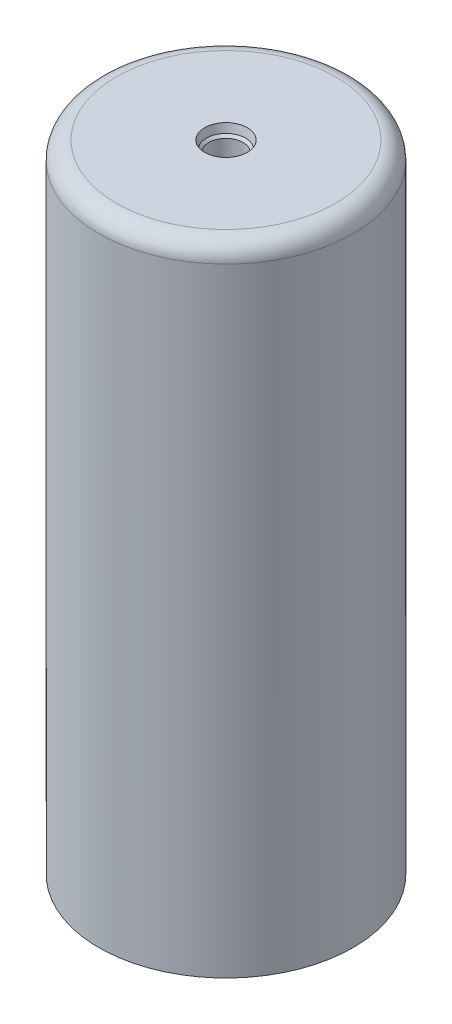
ISO-10303-21;
HEADER;
FILE_DESCRIPTION(('STEP AP214'),'2;1');
FILE_NAME('part.step','',(''),(''),'','','');
FILE_SCHEMA(('AUTOMOTIVE_DESIGN { 1 0 10303 214 1 1 1 1 }'));
ENDSEC;
DATA;
#1=APPLICATION_CONTEXT('core data for automotive mechanical design processes');
#2=APPLICATION_PROTOCOL_DEFINITION('international standard','automotive_design',2000,#1);
#3=PRODUCT_CONTEXT('',#1,'mechanical');
#4=PRODUCT('Part','Part','',(#3));
#5=PRODUCT_RELATED_PRODUCT_CATEGORY('part','',(#4));
#6=PRODUCT_DEFINITION_FORMATION('','',#4);
#7=PRODUCT_DEFINITION_CONTEXT('part definition',#1,'design');
#8=PRODUCT_DEFINITION('design','',#6,#7);
#9=PRODUCT_DEFINITION_SHAPE('','',#8);
#10=(LENGTH_UNIT() NAMED_UNIT(*) SI_UNIT(.MILLI.,.METRE.));
#11=(NAMED_UNIT(*) PLANE_ANGLE_UNIT() SI_UNIT($,.RADIAN.));
#12=(NAMED_UNIT(*) SI_UNIT($,.STERADIAN.) SOLID_ANGLE_UNIT());
#13=UNCERTAINTY_MEASURE_WITH_UNIT(LENGTH_MEASURE(1.E-05),#10,'distance_accuracy_value','');
#14=(GEOMETRIC_REPRESENTATION_CONTEXT(3) GLOBAL_UNCERTAINTY_ASSIGNED_CONTEXT((#13)) GLOBAL_UNIT_ASSIGNED_CONTEXT((#10,
#11,#12)) REPRESENTATION_CONTEXT('',''));
#15=CARTESIAN_POINT('',(0.,0.,0.));
#16=DIRECTION('',(0.,0.,1.));
#17=DIRECTION('',(1.,0.,0.));
#18=AXIS2_PLACEMENT_3D('',#15,#16,#17);
#19=CARTESIAN_POINT('',(-18.415,2.15899999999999,0.));
#20=DIRECTION('',(0.,1.,0.));
#21=DIRECTION('',(0.,0.,1.));
#22=AXIS2_PLACEMENT_3D('',#19,#20,#21);
#23=PLANE('',#22);
#24=DIRECTION('',(1.,0.,0.));
#25=VECTOR('',#24,1.);
#26=CARTESIAN_POINT('',(-36.831,2.15899999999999,-6.02609820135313));
#27=LINE('',#26,#25);
#28=CARTESIAN_POINT('',(-33.2401814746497,2.15899999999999,-6.02609820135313));
#29=VERTEX_POINT('',#28);
#30=CARTESIAN_POINT('',(-32.5946276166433,2.15899999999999,-6.02609820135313));
#31=VERTEX_POINT('',#30);
#32=EDGE_CURVE('E511',#29,#31,#27,.T.);
#33=ORIENTED_EDGE('',*,*,#32,.T.);
#34=CARTESIAN_POINT('',(0.,2.15899999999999,0.));
#35=DIRECTION('',(0.,-1.,0.));
#36=DIRECTION('',(0.,0.,-1.));
#37=AXIS2_PLACEMENT_3D('',#34,#35,#36);
#38=CIRCLE('',#37,33.147);
#39=CARTESIAN_POINT('',(-6.02416029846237,2.15899999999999,-32.5949858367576));
#40=VERTEX_POINT('',#39);
#41=EDGE_CURVE('E238',#31,#40,#38,.T.);
#42=ORIENTED_EDGE('',*,*,#41,.T.);
#43=DIRECTION('',(0.,0.,1.));
#44=VECTOR('',#43,1.);
#45=CARTESIAN_POINT('',(-6.02416029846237,2.15899999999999,-36.831));
#46=LINE('',#45,#44);
#47=CARTESIAN_POINT('',(-6.02416029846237,2.15899999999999,-33.2405327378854));
#48=VERTEX_POINT('',#47);
#49=EDGE_CURVE('E506',#40,#48,#46,.F.);
#50=ORIENTED_EDGE('',*,*,#49,.T.);
#51=CARTESIAN_POINT('',(0.,2.15899999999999,0.));
#52=DIRECTION('',(0.,-1.,0.));
#53=DIRECTION('',(0.,0.,-1.));
#54=AXIS2_PLACEMENT_3D('',#51,#52,#53);
#55=CIRCLE('',#54,33.782);
#56=EDGE_CURVE('E228',#29,#48,#55,.T.);
#57=ORIENTED_EDGE('',*,*,#56,.F.);
#58=EDGE_LOOP('',(#33,#42,#50,#57));
#59=FACE_BOUND('',#58,.T.);
#60=ADVANCED_FACE('F38',(#59),#23,.T.);
#61=CARTESIAN_POINT('',(0.,0.,0.));
#62=DIRECTION('',(0.,-1.,0.));
#63=DIRECTION('',(0.,0.,-1.));
#64=AXIS2_PLACEMENT_3D('',#61,#62,#63);
#65=CYLINDRICAL_SURFACE('',#64,33.782);
#66=CARTESIAN_POINT('',(-33.1798285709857,3.11912,-6.35));
#67=CARTESIAN_POINT('',(-33.1798278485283,3.07449107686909,-6.35000090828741));
#68=CARTESIAN_POINT('',(-33.1801895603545,3.02988247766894,-6.34811405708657));
#69=CARTESIAN_POINT('',(-33.1816282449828,2.94099790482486,-6.34059090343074));
#70=CARTESIAN_POINT('',(-33.1827051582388,2.89672190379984,-6.33495491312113));
#71=CARTESIAN_POINT('',(-33.1869149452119,2.76726237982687,-6.31287843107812));
#72=CARTESIAN_POINT('',(-33.1910289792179,2.68293685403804,-6.29126085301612));
#73=CARTESIAN_POINT('',(-33.2014931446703,2.52256542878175,-6.2357940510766));
#74=CARTESIAN_POINT('',(-33.2077418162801,2.446320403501,-6.20249824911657));
#75=CARTESIAN_POINT('',(-33.2186847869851,2.33573869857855,-6.14352633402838));
#76=CARTESIAN_POINT('',(-33.2226570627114,2.29905428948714,-6.12201980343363));
#77=CARTESIAN_POINT('',(-33.2310751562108,2.22756639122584,-6.07615916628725));
#78=CARTESIAN_POINT('',(-33.2355209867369,2.1927629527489,-6.05180498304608));
#79=CARTESIAN_POINT('',(-33.2401814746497,2.15899999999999,-6.02609820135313));
#80=B_SPLINE_CURVE_WITH_KNOTS('',3,(#66,#67,#68,#69,#70,#71,#72,#73,#74,#75,#76,#77,#78,#79),
.UNSPECIFIED.,.F.,.F.,(4,2,2,2,2,2,4),(0.,0.133805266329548,0.267599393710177,0.527753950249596,
0.776953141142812,0.904956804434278,1.0329639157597),.UNSPECIFIED.);
#81=CARTESIAN_POINT('',(-33.1798285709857,3.11912,-6.35));
#82=VERTEX_POINT('',#81);
#83=EDGE_CURVE('E222',#82,#29,#80,.T.);
#84=ORIENTED_EDGE('',*,*,#83,.T.);
#85=ORIENTED_EDGE('',*,*,#56,.T.);
#86=CARTESIAN_POINT('',(-6.02416029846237,2.15899999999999,-33.2405327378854));
#87=CARTESIAN_POINT('',(-6.05123182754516,2.19440785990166,-33.2356264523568));
#88=CARTESIAN_POINT('',(-6.07681270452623,2.23096431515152,-33.2309564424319));
#89=CARTESIAN_POINT('',(-6.12483033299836,2.30614826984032,-33.2221398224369));
#90=CARTESIAN_POINT('',(-6.14726697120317,2.34477584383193,-33.2179932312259));
#91=CARTESIAN_POINT('',(-6.20844845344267,2.46120493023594,-33.2066317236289));
#92=CARTESIAN_POINT('',(-6.24259571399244,2.54156624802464,-33.2002151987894));
#93=CARTESIAN_POINT('',(-6.29602043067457,2.70319559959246,-33.1901244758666));
#94=CARTESIAN_POINT('',(-6.3159008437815,2.78425804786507,-33.1863393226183));
#95=CARTESIAN_POINT('',(-6.33618699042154,2.90852741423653,-33.182469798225));
#96=CARTESIAN_POINT('',(-6.34136178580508,2.95097375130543,-33.1814808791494));
#97=CARTESIAN_POINT('',(-6.3482691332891,3.03616116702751,-33.1801598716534));
#98=CARTESIAN_POINT('',(-6.35000124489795,3.07890228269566,-33.1798278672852));
#99=CARTESIAN_POINT('',(-6.35,3.12166,-33.1798285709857));
#100=B_SPLINE_CURVE_WITH_KNOTS('',3,(#86,#87,#88,#89,#90,#91,#92,#93,#94,#95,#96,#97,#98,#99),
.UNSPECIFIED.,.F.,.F.,(4,2,2,2,2,2,4),(0.,0.134442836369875,0.268890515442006,0.530248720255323,
0.77978008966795,0.907967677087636,1.03617166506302),.UNSPECIFIED.);
#101=CARTESIAN_POINT('',(-6.35,3.12166,-33.1798285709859));
#102=VERTEX_POINT('',#101);
#103=EDGE_CURVE('E903',#48,#102,#100,.T.);
#104=ORIENTED_EDGE('',*,*,#103,.T.);
#105=DIRECTION('',(0.,-1.,0.));
#106=VECTOR('',#105,1.);
#107=CARTESIAN_POINT('',(-6.34999999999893,-2.16840434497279E-12,-33.1798285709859));
#108=LINE('',#107,#106);
#109=CARTESIAN_POINT('',(-6.35,3.1242,-33.1798285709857));
#110=VERTEX_POINT('',#109);
#111=EDGE_CURVE('E363',#102,#110,#108,.F.);
#112=ORIENTED_EDGE('',*,*,#111,.T.);
#113=CARTESIAN_POINT('',(-6.35,3.1242,-33.1798285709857));
#114=CARTESIAN_POINT('',(-6.34999976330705,3.16828508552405,-33.1798281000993));
#115=CARTESIAN_POINT('',(-6.34816230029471,3.21234815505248,-33.1801803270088));
#116=CARTESIAN_POINT('',(-6.34083420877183,3.30015616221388,-33.1815817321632));
#117=CARTESIAN_POINT('',(-6.33534375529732,3.34390111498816,-33.1826308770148));
#118=CARTESIAN_POINT('',(-6.31342888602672,3.47422838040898,-33.1868102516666));
#119=CARTESIAN_POINT('',(-6.29156093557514,3.55992945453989,-33.1909724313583));
#120=CARTESIAN_POINT('',(-6.23400920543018,3.72635485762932,-33.2018298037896));
#121=CARTESIAN_POINT('',(-6.19831957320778,3.807077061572,-33.2085260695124));
#122=CARTESIAN_POINT('',(-6.11424234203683,3.96123204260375,-33.2241083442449));
#123=CARTESIAN_POINT('',(-6.06588354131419,4.03468083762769,-33.2329893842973));
#124=CARTESIAN_POINT('',(-6.00017868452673,4.1185217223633,-33.2448721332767));
#125=CARTESIAN_POINT('',(-5.98812286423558,4.13334370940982,-33.2470459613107));
#126=CARTESIAN_POINT('',(-5.96350417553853,4.16251965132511,-33.2514706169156));
#127=CARTESIAN_POINT('',(-5.95094189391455,4.17687411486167,-33.2537213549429));
#128=CARTESIAN_POINT('',(-5.93812494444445,4.19099999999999,-33.2560099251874));
#129=B_SPLINE_CURVE_WITH_KNOTS('',3,(#113,#114,#115,#116,#117,#118,#119,#120,#121,#122,#123,
#124,#125,#126,#127,#128),.UNSPECIFIED.,.F.,.F.,(4,2,2,2,2,2,2,4),(0.,0.132171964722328,
0.26433759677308,0.52859081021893,0.792956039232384,1.05672547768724,1.11440684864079,
1.17202320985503),.UNSPECIFIED.);
#130=CARTESIAN_POINT('',(-5.93812494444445,4.19099999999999,-33.2560099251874));
#131=VERTEX_POINT('',#130);
#132=EDGE_CURVE('E356',#110,#131,#129,.T.);
#133=ORIENTED_EDGE('',*,*,#132,.T.);
#134=CARTESIAN_POINT('',(0.,4.19099999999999,0.));
#135=DIRECTION('',(0.,-1.,0.));
#136=DIRECTION('',(0.,0.,-1.));
#137=AXIS2_PLACEMENT_3D('',#134,#135,#136);
#138=CIRCLE('',#137,33.782);
#139=CARTESIAN_POINT('',(-33.2561692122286,4.19099999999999,-5.93723280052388));
#140=VERTEX_POINT('',#139);
#141=EDGE_CURVE('E229',#140,#131,#138,.T.);
#142=ORIENTED_EDGE('',*,*,#141,.F.);
#143=CARTESIAN_POINT('',(-33.2561692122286,4.19099999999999,-5.93723280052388));
#144=CARTESIAN_POINT('',(-33.2508775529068,4.1584304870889,-5.96687275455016));
#145=CARTESIAN_POINT('',(-33.2457869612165,4.12462350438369,-5.99515785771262));
#146=CARTESIAN_POINT('',(-33.2360605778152,4.05472873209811,-6.04884661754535));
#147=CARTESIAN_POINT('',(-33.2314248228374,4.01864075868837,-6.07425004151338));
#148=CARTESIAN_POINT('',(-33.2182723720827,3.90718964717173,-6.14591516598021));
#149=CARTESIAN_POINT('',(-33.2105199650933,3.82869716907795,-6.18757908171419));
#150=CARTESIAN_POINT('',(-33.1974563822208,3.66565460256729,-6.25729028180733));
#151=CARTESIAN_POINT('',(-33.1921478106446,3.58109816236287,-6.2853230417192));
#152=CARTESIAN_POINT('',(-33.1842668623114,3.40851565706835,-6.32680093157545));
#153=CARTESIAN_POINT('',(-33.1816868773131,3.32049995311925,-6.34028662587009));
#154=CARTESIAN_POINT('',(-33.1802974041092,3.21413578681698,-6.34754963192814));
#155=CARTESIAN_POINT('',(-33.1801215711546,3.19615259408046,-6.34846875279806));
#156=CARTESIAN_POINT('',(-33.1798873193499,3.16018155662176,-6.34969316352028));
#157=CARTESIAN_POINT('',(-33.1798287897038,3.14219373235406,-6.34999903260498));
#158=CARTESIAN_POINT('',(-33.1798285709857,3.1242,-6.35));
#159=B_SPLINE_CURVE_WITH_KNOTS('',3,(#143,#144,#145,#146,#147,#148,#149,#150,#151,#152,#153,
#154,#155,#156,#157,#158),.UNSPECIFIED.,.F.,.F.,(4,2,2,2,2,2,2,4),(0.,0.132982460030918,
0.265975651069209,0.532195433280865,0.798698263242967,1.06445601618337,1.1184737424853,
1.17244042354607),.UNSPECIFIED.);
#160=CARTESIAN_POINT('',(-33.1798285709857,3.1242,-6.35));
#161=VERTEX_POINT('',#160);
#162=EDGE_CURVE('E578',#140,#161,#159,.T.);
#163=ORIENTED_EDGE('',*,*,#162,.T.);
#164=DIRECTION('',(0.,-1.,0.));
#165=VECTOR('',#164,1.);
#166=CARTESIAN_POINT('',(-33.1798285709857,0.,-6.35));
#167=LINE('',#166,#165);
#168=EDGE_CURVE('E617',#161,#82,#167,.T.);
#169=ORIENTED_EDGE('',*,*,#168,.T.);
#170=EDGE_LOOP('',(#84,#85,#104,#112,#133,#142,#163,#169));
#171=FACE_BOUND('',#170,.T.);
#172=ADVANCED_FACE('F281',(#171),#65,.F.);
#173=CARTESIAN_POINT('',(-18.415,4.191,0.));
#174=DIRECTION('',(0.,1.,0.));
#175=DIRECTION('',(0.,0.,1.));
#176=AXIS2_PLACEMENT_3D('',#173,#174,#175);
#177=PLANE('',#176);
#178=CARTESIAN_POINT('',(5.93953940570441,4.19099999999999,-33.2557573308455));
#179=VERTEX_POINT('',#178);
#180=CARTESIAN_POINT('',(-33.2561692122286,4.19099999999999,5.93723280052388));
#181=VERTEX_POINT('',#180);
#182=EDGE_CURVE('E220',#179,#181,#138,.T.);
#183=ORIENTED_EDGE('',*,*,#182,.T.);
#184=DIRECTION('',(1.,0.,0.));
#185=VECTOR('',#184,1.);
#186=CARTESIAN_POINT('',(-36.831,4.191,5.93723280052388));
#187=LINE('',#186,#185);
#188=CARTESIAN_POINT('',(-32.6109318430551,4.191,5.93723280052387));
#189=VERTEX_POINT('',#188);
#190=EDGE_CURVE('E199',#189,#181,#187,.F.);
#191=ORIENTED_EDGE('',*,*,#190,.F.);
#192=CARTESIAN_POINT('',(0.,4.191,0.));
#193=DIRECTION('',(0.,-1.,0.));
#194=DIRECTION('',(0.,0.,-1.));
#195=AXIS2_PLACEMENT_3D('',#192,#193,#194);
#196=CIRCLE('',#195,33.147);
#197=CARTESIAN_POINT('',(5.93953940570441,4.191,-32.6105118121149));
#198=VERTEX_POINT('',#197);
#199=EDGE_CURVE('E233',#198,#189,#196,.T.);
#200=ORIENTED_EDGE('',*,*,#199,.F.);
#201=DIRECTION('',(0.,0.,1.));
#202=VECTOR('',#201,1.);
#203=CARTESIAN_POINT('',(5.93953940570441,4.191,-36.831));
#204=LINE('',#203,#202);
#205=EDGE_CURVE('E227',#179,#198,#204,.T.);
#206=ORIENTED_EDGE('',*,*,#205,.F.);
#207=EDGE_LOOP('',(#183,#191,#200,#206));
#208=FACE_BOUND('',#207,.T.);
#209=ADVANCED_FACE('F226',(#208),#177,.F.);
#210=CARTESIAN_POINT('',(0.,14.097,0.));
#211=DIRECTION('',(0.,-1.,0.));
#212=DIRECTION('',(0.,0.,-1.));
#213=AXIS2_PLACEMENT_3D('',#210,#211,#212);
#214=CONICAL_SURFACE('',#213,31.75,0.785398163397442);
#215=CARTESIAN_POINT('',(0.,14.351,0.));
#216=DIRECTION('',(0.,-1.,0.));
#217=DIRECTION('',(0.,0.,-1.));
#218=AXIS2_PLACEMENT_3D('',#215,#216,#217);
#219=CIRCLE('',#218,31.496);
#220=CARTESIAN_POINT('',(0.,14.351,-31.496));
#221=VERTEX_POINT('',#220);
#222=EDGE_CURVE('E245',#221,#221,#219,.T.);
#223=ORIENTED_EDGE('',*,*,#222,.F.);
#224=EDGE_LOOP('',(#223));
#225=FACE_BOUND('',#224,.T.);
#226=CARTESIAN_POINT('',(0.,14.097,0.));
#227=DIRECTION('',(0.,-1.,0.));
#228=DIRECTION('',(0.,0.,-1.));
#229=AXIS2_PLACEMENT_3D('',#226,#227,#228);
#230=CIRCLE('',#229,31.75);
#231=CARTESIAN_POINT('',(0.,14.097,-31.75));
#232=VERTEX_POINT('',#231);
#233=EDGE_CURVE('E475',#232,#232,#230,.T.);
#234=ORIENTED_EDGE('',*,*,#233,.T.);
#235=EDGE_LOOP('',(#234));
#236=FACE_BOUND('',#235,.T.);
#237=ADVANCED_FACE('F697',(#225,#236),#214,.F.);
#238=CARTESIAN_POINT('',(0.,0.,0.));
#239=DIRECTION('',(0.,-1.,0.));
#240=DIRECTION('',(0.,0.,-1.));
#241=AXIS2_PLACEMENT_3D('',#238,#239,#240);
#242=CYLINDRICAL_SURFACE('',#241,31.496);
#243=CARTESIAN_POINT('',(0.,169.545,0.));
#244=DIRECTION('',(0.,1.,0.));
#245=DIRECTION('',(0.,0.,1.));
#246=AXIS2_PLACEMENT_3D('',#243,#244,#245);
#247=CIRCLE('',#246,31.496);
#248=CARTESIAN_POINT('',(0.,169.545,31.496));
#249=VERTEX_POINT('',#248);
#250=EDGE_CURVE('E251',#249,#249,#247,.T.);
#251=ORIENTED_EDGE('',*,*,#250,.T.);
#252=EDGE_LOOP('',(#251));
#253=FACE_BOUND('',#252,.T.);
#254=ORIENTED_EDGE('',*,*,#222,.T.);
#255=EDGE_LOOP('',(#254));
#256=FACE_BOUND('',#255,.T.);
#257=ADVANCED_FACE('F694',(#253,#256),#242,.F.);
#258=CARTESIAN_POINT('',(-18.415,174.625,0.));
#259=DIRECTION('',(0.,1.,0.));
#260=DIRECTION('',(0.,0.,1.));
#261=AXIS2_PLACEMENT_3D('',#258,#259,#260);
#262=PLANE('',#261);
#263=CARTESIAN_POINT('',(0.,174.625,0.));
#264=DIRECTION('',(0.,1.,0.));
#265=DIRECTION('',(0.,0.,1.));
#266=AXIS2_PLACEMENT_3D('',#263,#264,#265);
#267=CIRCLE('',#266,4.96062);
#268=CARTESIAN_POINT('',(0.,174.625,4.96062));
#269=VERTEX_POINT('',#268);
#270=EDGE_CURVE('E42',#269,#269,#267,.T.);
#271=ORIENTED_EDGE('',*,*,#270,.T.);
#272=EDGE_LOOP('',(#271));
#273=FACE_BOUND('',#272,.T.);
#274=CARTESIAN_POINT('',(0.,174.625,0.));
#275=DIRECTION('',(0.,1.,0.));
#276=DIRECTION('',(0.,0.,1.));
#277=AXIS2_PLACEMENT_3D('',#274,#275,#276);
#278=CIRCLE('',#277,26.416);
#279=CARTESIAN_POINT('',(0.,174.625,26.416));
#280=VERTEX_POINT('',#279);
#281=EDGE_CURVE('E248',#280,#280,#278,.F.);
#282=ORIENTED_EDGE('',*,*,#281,.T.);
#283=EDGE_LOOP('',(#282));
#284=FACE_BOUND('',#283,.T.);
#285=ADVANCED_FACE('F675',(#273,#284),#262,.F.);
#286=CARTESIAN_POINT('',(-18.415,184.15,0.));
#287=DIRECTION('',(0.,1.,0.));
#288=DIRECTION('',(0.,0.,1.));
#289=AXIS2_PLACEMENT_3D('',#286,#287,#288);
#290=PLANE('',#289);
#291=CARTESIAN_POINT('',(0.,184.15,0.));
#292=DIRECTION('',(0.,1.,0.));
#293=DIRECTION('',(0.,0.,1.));
#294=AXIS2_PLACEMENT_3D('',#291,#292,#293);
#295=CIRCLE('',#294,6.1849);
#296=CARTESIAN_POINT('',(0.,184.15,6.1849));
#297=VERTEX_POINT('',#296);
#298=EDGE_CURVE('E661',#297,#297,#295,.T.);
#299=ORIENTED_EDGE('',*,*,#298,.F.);
#300=EDGE_LOOP('',(#299));
#301=FACE_BOUND('',#300,.T.);
#302=CARTESIAN_POINT('',(0.,184.15,0.));
#303=DIRECTION('',(0.,1.,0.));
#304=DIRECTION('',(0.,0.,1.));
#305=AXIS2_PLACEMENT_3D('',#302,#303,#304);
#306=CIRCLE('',#305,31.75);
#307=CARTESIAN_POINT('',(0.,184.15,31.75));
#308=VERTEX_POINT('',#307);
#309=EDGE_CURVE('E257',#308,#308,#306,.T.);
#310=ORIENTED_EDGE('',*,*,#309,.T.);
#311=EDGE_LOOP('',(#310));
#312=FACE_BOUND('',#311,.T.);
#313=ADVANCED_FACE('F672',(#301,#312),#290,.T.);
#314=CARTESIAN_POINT('',(0.,0.,0.));
#315=DIRECTION('',(0.,-1.,0.));
#316=DIRECTION('',(0.,0.,-1.));
#317=AXIS2_PLACEMENT_3D('',#314,#315,#316);
#318=CYLINDRICAL_SURFACE('',#317,36.83);
#319=CARTESIAN_POINT('',(-36.2784564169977,3.1242,-6.35));
#320=CARTESIAN_POINT('',(-36.278455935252,3.16834311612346,-6.35000006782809));
#321=CARTESIAN_POINT('',(-36.2787794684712,3.21246487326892,-6.34815465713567));
#322=CARTESIAN_POINT('',(-36.2800666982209,3.30038815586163,-6.34079498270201));
#323=CARTESIAN_POINT('',(-36.2810303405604,3.34418970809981,-6.33528102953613));
#324=CARTESIAN_POINT('',(-36.2848642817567,3.47452434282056,-6.31330019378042));
#325=CARTESIAN_POINT('',(-36.2886776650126,3.560177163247,-6.29139411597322));
#326=CARTESIAN_POINT('',(-36.2986262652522,3.7265204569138,-6.23373694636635));
#327=CARTESIAN_POINT('',(-36.3047621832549,3.80720942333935,-6.1979816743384));
#328=CARTESIAN_POINT('',(-36.3190505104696,3.96142148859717,-6.11369692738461));
#329=CARTESIAN_POINT('',(-36.3272028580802,4.03494480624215,-6.06516784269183));
#330=CARTESIAN_POINT('',(-36.3452056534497,4.17334870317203,-5.95633959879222));
#331=CARTESIAN_POINT('',(-36.3550683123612,4.23816073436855,-5.8959553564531));
#332=CARTESIAN_POINT('',(-36.3760071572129,4.35677530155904,-5.76535936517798));
#333=CARTESIAN_POINT('',(-36.3870836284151,4.41057524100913,-5.69514530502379));
#334=CARTESIAN_POINT('',(-36.4101378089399,4.5063704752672,-5.54585784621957));
#335=CARTESIAN_POINT('',(-36.4221256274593,4.5481974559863,-5.46667809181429));
#336=CARTESIAN_POINT('',(-36.4463934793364,4.61792532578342,-5.30246872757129));
#337=CARTESIAN_POINT('',(-36.4586733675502,4.64583298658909,-5.21744198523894));
#338=CARTESIAN_POINT('',(-36.4792971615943,4.68059822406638,-5.07084197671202));
#339=CARTESIAN_POINT('',(-36.4876826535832,4.69129783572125,-5.01015703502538));
#340=CARTESIAN_POINT('',(-36.5042476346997,4.70557872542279,-4.88801010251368));
#341=CARTESIAN_POINT('',(-36.5124273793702,4.70916931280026,-4.82654923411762));
#342=CARTESIAN_POINT('',(-36.5204503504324,4.70916,-4.76504));
#343=B_SPLINE_CURVE_WITH_KNOTS('',3,(#319,#320,#321,#322,#323,#324,#325,#326,#327,#328,#329,
#330,#331,#332,#333,#334,#335,#336,#337,#338,#339,#340,#341,#342),.UNSPECIFIED.,.F.,.F.,(4,2,2,
2,2,2,2,2,2,2,2,4),(0.,0.132347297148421,0.264683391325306,0.528793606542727,0.792983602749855,
1.05716552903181,1.32331775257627,1.5895326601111,1.85932432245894,2.12898460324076,
2.31516245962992,2.50109635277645),.UNSPECIFIED.);
#344=CARTESIAN_POINT('',(-36.2784564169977,3.1242,-6.35));
#345=VERTEX_POINT('',#344);
#346=CARTESIAN_POINT('',(-36.5204503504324,4.70916,-4.76504));
#347=VERTEX_POINT('',#346);
#348=EDGE_CURVE('E594',#345,#347,#343,.T.);
#349=ORIENTED_EDGE('',*,*,#348,.T.);
#350=CARTESIAN_POINT('',(0.,4.70916,0.));
#351=DIRECTION('',(0.,1.,0.));
#352=DIRECTION('',(0.,0.,1.));
#353=AXIS2_PLACEMENT_3D('',#350,#351,#352);
#354=CIRCLE('',#353,36.83);
#355=CARTESIAN_POINT('',(-36.5204503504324,4.70916,4.76504));
#356=VERTEX_POINT('',#355);
#357=EDGE_CURVE('E519',#347,#356,#354,.T.);
#358=ORIENTED_EDGE('',*,*,#357,.T.);
#359=CARTESIAN_POINT('',(-36.5204503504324,4.70916,4.76504));
#360=CARTESIAN_POINT('',(-36.5145780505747,4.70915952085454,4.81005039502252));
#361=CARTESIAN_POINT('',(-36.5086243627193,4.70724151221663,4.85502787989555));
#362=CARTESIAN_POINT('',(-36.4965955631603,4.69959416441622,4.94463862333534));
#363=CARTESIAN_POINT('',(-36.4905204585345,4.69386504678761,4.98927190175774));
#364=CARTESIAN_POINT('',(-36.4721926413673,4.67101952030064,5.12211061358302));
#365=CARTESIAN_POINT('',(-36.4598192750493,4.6482447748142,5.20939380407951));
#366=CARTESIAN_POINT('',(-36.4352050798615,4.5882433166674,5.37885554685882));
#367=CARTESIAN_POINT('',(-36.4229643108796,4.55101033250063,5.4610318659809));
#368=CARTESIAN_POINT('',(-36.3990899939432,4.46312146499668,5.6179575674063));
#369=CARTESIAN_POINT('',(-36.3874563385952,4.41246796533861,5.6927082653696));
#370=CARTESIAN_POINT('',(-36.36530303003,4.2991924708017,5.83255113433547));
#371=CARTESIAN_POINT('',(-36.3547820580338,4.2365848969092,5.89765477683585));
#372=CARTESIAN_POINT('',(-36.3353179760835,4.10107475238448,6.01641073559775));
#373=CARTESIAN_POINT('',(-36.3263751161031,4.02817055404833,6.0700612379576));
#374=CARTESIAN_POINT('',(-36.3105849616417,3.8748897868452,6.16381103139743));
#375=CARTESIAN_POINT('',(-36.303718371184,3.79459168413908,6.20403548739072));
#376=CARTESIAN_POINT('',(-36.2923186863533,3.62824024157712,6.27037847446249));
#377=CARTESIAN_POINT('',(-36.2877837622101,3.54219147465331,6.29650806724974));
#378=CARTESIAN_POINT('',(-36.2825190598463,3.40029459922,6.32675632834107));
#379=CARTESIAN_POINT('',(-36.2809980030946,3.34541210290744,6.33546703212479));
#380=CARTESIAN_POINT('',(-36.2789661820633,3.23509493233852,6.34708782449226));
#381=CARTESIAN_POINT('',(-36.278454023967,3.17966112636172,6.35000591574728));
#382=CARTESIAN_POINT('',(-36.2784564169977,3.1242,6.35));
#383=B_SPLINE_CURVE_WITH_KNOTS('',3,(#359,#360,#361,#362,#363,#364,#365,#366,#367,#368,#369,
#370,#371,#372,#373,#374,#375,#376,#377,#378,#379,#380,#381,#382),.UNSPECIFIED.,.F.,.F.,(4,2,2,
2,2,2,2,2,2,2,2,4),(0.,0.136091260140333,0.272174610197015,0.543926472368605,0.815796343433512,
1.08761795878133,1.35911370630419,1.63065242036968,1.89958397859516,2.16830416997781,
2.33478546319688,2.50103659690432),.UNSPECIFIED.);
#384=CARTESIAN_POINT('',(-36.2784564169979,3.1242,6.34999999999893));
#385=VERTEX_POINT('',#384);
#386=EDGE_CURVE('E515',#356,#385,#383,.T.);
#387=ORIENTED_EDGE('',*,*,#386,.T.);
#388=DIRECTION('',(0.,-1.,0.));
#389=VECTOR('',#388,1.);
#390=CARTESIAN_POINT('',(-36.2784564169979,-2.16840434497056E-12,6.34999999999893));
#391=LINE('',#390,#389);
#392=CARTESIAN_POINT('',(-36.2784564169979,3.11912,6.34999999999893));
#393=VERTEX_POINT('',#392);
#394=EDGE_CURVE('E308',#385,#393,#391,.T.);
#395=ORIENTED_EDGE('',*,*,#394,.T.);
#396=CARTESIAN_POINT('',(-36.2784564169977,3.11912,6.35));
#397=CARTESIAN_POINT('',(-36.278455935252,3.07497688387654,6.35000006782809));
#398=CARTESIAN_POINT('',(-36.2787794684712,3.03085512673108,6.34815465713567));
#399=CARTESIAN_POINT('',(-36.2800666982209,2.94293184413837,6.34079498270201));
#400=CARTESIAN_POINT('',(-36.2810303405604,2.89913029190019,6.33528102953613));
#401=CARTESIAN_POINT('',(-36.2848642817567,2.76879565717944,6.31330019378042));
#402=CARTESIAN_POINT('',(-36.2886776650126,2.683142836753,6.29139411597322));
#403=CARTESIAN_POINT('',(-36.2986262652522,2.5167995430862,6.23373694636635));
#404=CARTESIAN_POINT('',(-36.3047621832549,2.43611057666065,6.1979816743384));
#405=CARTESIAN_POINT('',(-36.3190505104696,2.28189851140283,6.11369692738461));
#406=CARTESIAN_POINT('',(-36.3272028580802,2.20837519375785,6.06516784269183));
#407=CARTESIAN_POINT('',(-36.3452056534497,2.06997129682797,5.95633959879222));
#408=CARTESIAN_POINT('',(-36.3550683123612,2.00515926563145,5.8959553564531));
#409=CARTESIAN_POINT('',(-36.3760071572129,1.88654469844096,5.76535936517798));
#410=CARTESIAN_POINT('',(-36.3870836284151,1.83274475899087,5.69514530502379));
#411=CARTESIAN_POINT('',(-36.4101378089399,1.7369495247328,5.54585784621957));
#412=CARTESIAN_POINT('',(-36.4221256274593,1.6951225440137,5.46667809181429));
#413=CARTESIAN_POINT('',(-36.4463934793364,1.62539467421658,5.30246872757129));
#414=CARTESIAN_POINT('',(-36.4586733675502,1.59748701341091,5.21744198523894));
#415=CARTESIAN_POINT('',(-36.4792971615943,1.56272177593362,5.07084197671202));
#416=CARTESIAN_POINT('',(-36.4876826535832,1.55202216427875,5.01015703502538));
#417=CARTESIAN_POINT('',(-36.5042476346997,1.53774127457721,4.88801010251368));
#418=CARTESIAN_POINT('',(-36.5124273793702,1.53415068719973,4.82654923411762));
#419=CARTESIAN_POINT('',(-36.5204503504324,1.53416,4.76504));
#420=B_SPLINE_CURVE_WITH_KNOTS('',3,(#396,#397,#398,#399,#400,#401,#402,#403,#404,#405,#406,
#407,#408,#409,#410,#411,#412,#413,#414,#415,#416,#417,#418,#419),.UNSPECIFIED.,.F.,.F.,(4,2,2,
2,2,2,2,2,2,2,2,4),(0.,0.132347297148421,0.264683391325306,0.528793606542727,0.792983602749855,
1.05716552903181,1.32331775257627,1.5895326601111,1.85932432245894,2.12898460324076,
2.31516245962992,2.50109635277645),.UNSPECIFIED.);
#421=CARTESIAN_POINT('',(-36.5204503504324,1.53416,4.76504));
#422=VERTEX_POINT('',#421);
#423=EDGE_CURVE('E570',#393,#422,#420,.T.);
#424=ORIENTED_EDGE('',*,*,#423,.T.);
#425=CARTESIAN_POINT('',(0.,1.53416,0.));
#426=DIRECTION('',(0.,-1.,0.));
#427=DIRECTION('',(0.,0.,-1.));
#428=AXIS2_PLACEMENT_3D('',#425,#426,#427);
#429=CIRCLE('',#428,36.83);
#430=CARTESIAN_POINT('',(-36.5204503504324,1.53416,-4.76504));
#431=VERTEX_POINT('',#430);
#432=EDGE_CURVE('E577',#422,#431,#429,.T.);
#433=ORIENTED_EDGE('',*,*,#432,.T.);
#434=CARTESIAN_POINT('',(-36.5204503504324,1.53416,-4.76504));
#435=CARTESIAN_POINT('',(-36.5145780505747,1.53416047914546,-4.81005039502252));
#436=CARTESIAN_POINT('',(-36.5086243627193,1.53607848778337,-4.85502787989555));
#437=CARTESIAN_POINT('',(-36.4965955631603,1.54372583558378,-4.94463862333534));
#438=CARTESIAN_POINT('',(-36.4905204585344,1.54945495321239,-4.98927190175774));
#439=CARTESIAN_POINT('',(-36.4721926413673,1.57230047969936,-5.12211061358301));
#440=CARTESIAN_POINT('',(-36.4598192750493,1.5950752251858,-5.20939380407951));
#441=CARTESIAN_POINT('',(-36.4352050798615,1.6550766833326,-5.37885554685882));
#442=CARTESIAN_POINT('',(-36.4229643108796,1.69230966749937,-5.4610318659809));
#443=CARTESIAN_POINT('',(-36.3990899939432,1.78019853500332,-5.6179575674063));
#444=CARTESIAN_POINT('',(-36.3874563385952,1.83085203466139,-5.6927082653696));
#445=CARTESIAN_POINT('',(-36.36530303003,1.9441275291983,-5.83255113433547));
#446=CARTESIAN_POINT('',(-36.3547820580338,2.0067351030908,-5.89765477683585));
#447=CARTESIAN_POINT('',(-36.3353179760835,2.14224524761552,-6.01641073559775));
#448=CARTESIAN_POINT('',(-36.3263751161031,2.21514944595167,-6.07006123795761));
#449=CARTESIAN_POINT('',(-36.3105849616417,2.3684302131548,-6.16381103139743));
#450=CARTESIAN_POINT('',(-36.303718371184,2.44872831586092,-6.20403548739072));
#451=CARTESIAN_POINT('',(-36.2923186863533,2.61507975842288,-6.27037847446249));
#452=CARTESIAN_POINT('',(-36.2877837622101,2.70112852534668,-6.29650806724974));
#453=CARTESIAN_POINT('',(-36.2825190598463,2.84302540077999,-6.32675632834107));
#454=CARTESIAN_POINT('',(-36.2809980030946,2.89790789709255,-6.33546703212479));
#455=CARTESIAN_POINT('',(-36.2789661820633,3.00822506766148,-6.34708782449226));
#456=CARTESIAN_POINT('',(-36.278454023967,3.06365887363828,-6.35000591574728));
#457=CARTESIAN_POINT('',(-36.2784564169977,3.11912,-6.35));
#458=B_SPLINE_CURVE_WITH_KNOTS('',3,(#434,#435,#436,#437,#438,#439,#440,#441,#442,#443,#444,
#445,#446,#447,#448,#449,#450,#451,#452,#453,#454,#455,#456,#457),.UNSPECIFIED.,.F.,.F.,(4,2,2,
2,2,2,2,2,2,2,2,4),(0.,0.136091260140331,0.272174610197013,0.543926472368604,0.81579634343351,
1.08761795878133,1.35911370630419,1.63065242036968,1.89958397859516,2.16830416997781,
2.33478546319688,2.50103659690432),.UNSPECIFIED.);
#459=CARTESIAN_POINT('',(-36.2784564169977,3.11912,-6.35));
#460=VERTEX_POINT('',#459);
#461=EDGE_CURVE('E585',#431,#460,#458,.T.);
#462=ORIENTED_EDGE('',*,*,#461,.T.);
#463=DIRECTION('',(0.,-1.,0.));
#464=VECTOR('',#463,1.);
#465=CARTESIAN_POINT('',(-36.2784564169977,0.,-6.35));
#466=LINE('',#465,#464);
#467=EDGE_CURVE('E591',#460,#345,#466,.F.);
#468=ORIENTED_EDGE('',*,*,#467,.T.);
#469=EDGE_LOOP('',(#349,#358,#387,#395,#424,#433,#462,#468));
#470=FACE_BOUND('',#469,.T.);
#471=CARTESIAN_POINT('',(-6.35,3.12166,-36.2784564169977));
#472=CARTESIAN_POINT('',(-6.35000006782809,3.07751688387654,-36.278455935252));
#473=CARTESIAN_POINT('',(-6.34815465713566,3.03339512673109,-36.2787794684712));
#474=CARTESIAN_POINT('',(-6.34079498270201,2.94547184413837,-36.2800666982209));
#475=CARTESIAN_POINT('',(-6.33528102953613,2.9016702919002,-36.2810303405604));
#476=CARTESIAN_POINT('',(-6.31330019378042,2.77133565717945,-36.2848642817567));
#477=CARTESIAN_POINT('',(-6.29139411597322,2.68568283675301,-36.2886776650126));
#478=CARTESIAN_POINT('',(-6.23373694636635,2.5193395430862,-36.2986262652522));
#479=CARTESIAN_POINT('',(-6.1979816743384,2.43865057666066,-36.3047621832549));
#480=CARTESIAN_POINT('',(-6.1136969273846,2.28443851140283,-36.3190505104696));
#481=CARTESIAN_POINT('',(-6.06516784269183,2.21091519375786,-36.3272028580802));
#482=CARTESIAN_POINT('',(-5.95633959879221,2.07251129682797,-36.3452056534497));
#483=CARTESIAN_POINT('',(-5.8959553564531,2.00769926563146,-36.3550683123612));
#484=CARTESIAN_POINT('',(-5.76535936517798,1.88908469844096,-36.3760071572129));
#485=CARTESIAN_POINT('',(-5.69514530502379,1.83528475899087,-36.3870836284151));
#486=CARTESIAN_POINT('',(-5.54585784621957,1.73948952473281,-36.4101378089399));
#487=CARTESIAN_POINT('',(-5.46667809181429,1.6976625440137,-36.4221256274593));
#488=CARTESIAN_POINT('',(-5.30246872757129,1.62793467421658,-36.4463934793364));
#489=CARTESIAN_POINT('',(-5.21744198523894,1.60002701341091,-36.4586733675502));
#490=CARTESIAN_POINT('',(-5.07084197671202,1.56526177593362,-36.4792971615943));
#491=CARTESIAN_POINT('',(-5.01015703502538,1.55456216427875,-36.4876826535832));
#492=CARTESIAN_POINT('',(-4.88801010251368,1.54028127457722,-36.5042476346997));
#493=CARTESIAN_POINT('',(-4.82654923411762,1.53669068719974,-36.5124273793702));
#494=CARTESIAN_POINT('',(-4.76504,1.53670000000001,-36.5204503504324));
#495=B_SPLINE_CURVE_WITH_KNOTS('',3,(#471,#472,#473,#474,#475,#476,#477,#478,#479,#480,#481,
#482,#483,#484,#485,#486,#487,#488,#489,#490,#491,#492,#493,#494),.UNSPECIFIED.,.F.,.F.,(4,2,2,
2,2,2,2,2,2,2,2,4),(0.,0.132347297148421,0.264683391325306,0.528793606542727,0.792983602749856,
1.05716552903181,1.32331775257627,1.5895326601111,1.85932432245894,2.12898460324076,
2.31516245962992,2.50109635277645),.UNSPECIFIED.);
#496=CARTESIAN_POINT('',(-6.34999999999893,3.12166,-36.2784564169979));
#497=VERTEX_POINT('',#496);
#498=CARTESIAN_POINT('',(-4.76504,1.53670000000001,-36.5204503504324));
#499=VERTEX_POINT('',#498);
#500=EDGE_CURVE('E445',#497,#499,#495,.T.);
#501=ORIENTED_EDGE('',*,*,#500,.T.);
#502=CARTESIAN_POINT('',(0.,1.53670000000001,0.));
#503=DIRECTION('',(0.,-1.,0.));
#504=DIRECTION('',(1.,0.,0.));
#505=AXIS2_PLACEMENT_3D('',#502,#503,#504);
#506=CIRCLE('',#505,36.83);
#507=CARTESIAN_POINT('',(4.76504,1.53670000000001,-36.5204503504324));
#508=VERTEX_POINT('',#507);
#509=EDGE_CURVE('E319',#499,#508,#506,.T.);
#510=ORIENTED_EDGE('',*,*,#509,.T.);
#511=CARTESIAN_POINT('',(4.76504,1.53670000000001,-36.5204503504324));
#512=CARTESIAN_POINT('',(4.81005039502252,1.53670047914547,-36.5145780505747));
#513=CARTESIAN_POINT('',(4.85502787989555,1.53861848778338,-36.5086243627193));
#514=CARTESIAN_POINT('',(4.94463862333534,1.54626583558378,-36.4965955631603));
#515=CARTESIAN_POINT('',(4.98927190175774,1.55199495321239,-36.4905204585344));
#516=CARTESIAN_POINT('',(5.12211061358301,1.57484047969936,-36.4721926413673));
#517=CARTESIAN_POINT('',(5.20939380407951,1.59761522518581,-36.4598192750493));
#518=CARTESIAN_POINT('',(5.37885554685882,1.65761668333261,-36.4352050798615));
#519=CARTESIAN_POINT('',(5.4610318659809,1.69484966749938,-36.4229643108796));
#520=CARTESIAN_POINT('',(5.6179575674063,1.78273853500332,-36.3990899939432));
#521=CARTESIAN_POINT('',(5.6927082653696,1.8333920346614,-36.3874563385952));
#522=CARTESIAN_POINT('',(5.83255113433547,1.94666752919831,-36.36530303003));
#523=CARTESIAN_POINT('',(5.89765477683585,2.00927510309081,-36.3547820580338));
#524=CARTESIAN_POINT('',(6.01641073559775,2.14478524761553,-36.3353179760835));
#525=CARTESIAN_POINT('',(6.0700612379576,2.21768944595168,-36.3263751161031));
#526=CARTESIAN_POINT('',(6.16381103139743,2.3709702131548,-36.3105849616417));
#527=CARTESIAN_POINT('',(6.20403548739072,2.45126831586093,-36.303718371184));
#528=CARTESIAN_POINT('',(6.27037847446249,2.61761975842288,-36.2923186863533));
#529=CARTESIAN_POINT('',(6.29650806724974,2.70366852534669,-36.2877837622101));
#530=CARTESIAN_POINT('',(6.32675632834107,2.84556540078,-36.2825190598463));
#531=CARTESIAN_POINT('',(6.33546703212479,2.90044789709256,-36.2809980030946));
#532=CARTESIAN_POINT('',(6.34708782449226,3.01076506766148,-36.2789661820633));
#533=CARTESIAN_POINT('',(6.35000591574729,3.06619887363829,-36.278454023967));
#534=CARTESIAN_POINT('',(6.35,3.12166000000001,-36.2784564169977));
#535=B_SPLINE_CURVE_WITH_KNOTS('',3,(#511,#512,#513,#514,#515,#516,#517,#518,#519,#520,#521,
#522,#523,#524,#525,#526,#527,#528,#529,#530,#531,#532,#533,#534),.UNSPECIFIED.,.F.,.F.,(4,2,2,
2,2,2,2,2,2,2,2,4),(0.,0.136091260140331,0.272174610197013,0.543926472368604,0.815796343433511,
1.08761795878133,1.35911370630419,1.63065242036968,1.89958397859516,2.16830416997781,
2.33478546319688,2.50103659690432),.UNSPECIFIED.);
#536=CARTESIAN_POINT('',(6.35,3.12166000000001,-36.2784564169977));
#537=VERTEX_POINT('',#536);
#538=EDGE_CURVE('E422',#508,#537,#535,.T.);
#539=ORIENTED_EDGE('',*,*,#538,.T.);
#540=DIRECTION('',(0.,-1.,0.));
#541=VECTOR('',#540,1.);
#542=CARTESIAN_POINT('',(6.35000000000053,1.08420217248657E-12,-36.2784564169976));
#543=LINE('',#542,#541);
#544=CARTESIAN_POINT('',(6.35000000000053,3.12674,-36.2784564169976));
#545=VERTEX_POINT('',#544);
#546=EDGE_CURVE('E462',#537,#545,#543,.F.);
#547=ORIENTED_EDGE('',*,*,#546,.T.);
#548=CARTESIAN_POINT('',(6.35,3.12674,-36.2784564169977));
#549=CARTESIAN_POINT('',(6.35000006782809,3.17088311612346,-36.278455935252));
#550=CARTESIAN_POINT('',(6.34815465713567,3.21500487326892,-36.2787794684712));
#551=CARTESIAN_POINT('',(6.34079498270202,3.30292815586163,-36.2800666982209));
#552=CARTESIAN_POINT('',(6.33528102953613,3.34672970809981,-36.2810303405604));
#553=CARTESIAN_POINT('',(6.31330019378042,3.47706434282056,-36.2848642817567));
#554=CARTESIAN_POINT('',(6.29139411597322,3.562717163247,-36.2886776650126));
#555=CARTESIAN_POINT('',(6.23373694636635,3.7290604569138,-36.2986262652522));
#556=CARTESIAN_POINT('',(6.1979816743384,3.80974942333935,-36.3047621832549));
#557=CARTESIAN_POINT('',(6.11369692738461,3.96396148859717,-36.3190505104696));
#558=CARTESIAN_POINT('',(6.06516784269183,4.03748480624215,-36.3272028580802));
#559=CARTESIAN_POINT('',(5.95633959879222,4.17588870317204,-36.3452056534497));
#560=CARTESIAN_POINT('',(5.8959553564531,4.24070073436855,-36.3550683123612));
#561=CARTESIAN_POINT('',(5.76535936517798,4.35931530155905,-36.3760071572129));
#562=CARTESIAN_POINT('',(5.6951453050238,4.41311524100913,-36.3870836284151));
#563=CARTESIAN_POINT('',(5.54585784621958,4.5089104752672,-36.4101378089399));
#564=CARTESIAN_POINT('',(5.46667809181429,4.55073745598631,-36.4221256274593));
#565=CARTESIAN_POINT('',(5.30246872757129,4.62046532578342,-36.4463934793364));
#566=CARTESIAN_POINT('',(5.21744198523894,4.6483729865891,-36.4586733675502));
#567=CARTESIAN_POINT('',(5.07084197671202,4.68313822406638,-36.4792971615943));
#568=CARTESIAN_POINT('',(5.01015703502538,4.69383783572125,-36.4876826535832));
#569=CARTESIAN_POINT('',(4.88801010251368,4.70811872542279,-36.5042476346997));
#570=CARTESIAN_POINT('',(4.82654923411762,4.71170931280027,-36.5124273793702));
#571=CARTESIAN_POINT('',(4.76504,4.7117,-36.5204503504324));
#572=B_SPLINE_CURVE_WITH_KNOTS('',3,(#548,#549,#550,#551,#552,#553,#554,#555,#556,#557,#558,
#559,#560,#561,#562,#563,#564,#565,#566,#567,#568,#569,#570,#571),.UNSPECIFIED.,.F.,.F.,(4,2,2,
2,2,2,2,2,2,2,2,4),(0.,0.13234729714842,0.264683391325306,0.528793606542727,0.792983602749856,
1.05716552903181,1.32331775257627,1.5895326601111,1.85932432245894,2.12898460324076,
2.31516245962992,2.50109635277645),.UNSPECIFIED.);
#573=CARTESIAN_POINT('',(4.76504,4.7117,-36.5204503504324));
#574=VERTEX_POINT('',#573);
#575=EDGE_CURVE('E456',#545,#574,#572,.T.);
#576=ORIENTED_EDGE('',*,*,#575,.T.);
#577=CARTESIAN_POINT('',(0.,4.7117,0.));
#578=DIRECTION('',(0.,1.,0.));
#579=DIRECTION('',(0.,0.,1.));
#580=AXIS2_PLACEMENT_3D('',#577,#578,#579);
#581=CIRCLE('',#580,36.83);
#582=CARTESIAN_POINT('',(-4.7625,4.7117,-36.5207816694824));
#583=VERTEX_POINT('',#582);
#584=EDGE_CURVE('E461',#574,#583,#581,.T.);
#585=ORIENTED_EDGE('',*,*,#584,.T.);
#586=CARTESIAN_POINT('',(-4.7625,4.7117,-36.5207816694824));
#587=CARTESIAN_POINT('',(-4.80758232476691,4.71169952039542,-36.5149031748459));
#588=CARTESIAN_POINT('',(-4.85263167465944,4.70977845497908,-36.5089430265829));
#589=CARTESIAN_POINT('',(-4.9423855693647,4.70211892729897,-36.49690082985));
#590=CARTESIAN_POINT('',(-4.98709013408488,4.69638068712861,-36.490818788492));
#591=CARTESIAN_POINT('',(-5.12014092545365,4.67349880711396,-36.4724695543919));
#592=CARTESIAN_POINT('',(-5.20756339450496,4.65068784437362,-36.4600810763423));
#593=CARTESIAN_POINT('',(-5.37729544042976,4.59059108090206,-36.4354356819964));
#594=CARTESIAN_POINT('',(-5.45960278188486,4.55329900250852,-36.4231788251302));
#595=CARTESIAN_POINT('',(-5.61677869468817,4.46527076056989,-36.3992722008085));
#596=CARTESIAN_POINT('',(-5.69164858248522,4.41453698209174,-36.3876223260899));
#597=CARTESIAN_POINT('',(-5.83171512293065,4.30108159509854,-36.365437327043));
#598=CARTESIAN_POINT('',(-5.89692318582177,4.23837433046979,-36.3549008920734));
#599=CARTESIAN_POINT('',(-6.01586974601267,4.10264840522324,-36.3354077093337));
#600=CARTESIAN_POINT('',(-6.06960642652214,4.02962811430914,-36.3264512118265));
#601=CARTESIAN_POINT('',(-6.1635074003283,3.87610262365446,-36.310636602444));
#602=CARTESIAN_POINT('',(-6.20379695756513,3.79567595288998,-36.3037591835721));
#603=CARTESIAN_POINT('',(-6.2702475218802,3.62905804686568,-36.2923413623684));
#604=CARTESIAN_POINT('',(-6.29641960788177,3.54287139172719,-36.2877991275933));
#605=CARTESIAN_POINT('',(-6.32671765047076,3.40074547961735,-36.2825258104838));
#606=CARTESIAN_POINT('',(-6.33544284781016,3.34577338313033,-36.2810022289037));
#607=CARTESIAN_POINT('',(-6.34708297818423,3.23527606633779,-36.2789670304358));
#608=CARTESIAN_POINT('',(-6.35000592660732,3.17975171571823,-36.2784540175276));
#609=CARTESIAN_POINT('',(-6.35,3.1242,-36.2784564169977));
#610=B_SPLINE_CURVE_WITH_KNOTS('',3,(#586,#587,#588,#589,#590,#591,#592,#593,#594,#595,#596,
#597,#598,#599,#600,#601,#602,#603,#604,#605,#606,#607,#608,#609),.UNSPECIFIED.,.F.,.F.,(4,2,2,
2,2,2,2,2,2,2,2,4),(0.,0.136307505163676,0.272607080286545,0.54479060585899,0.817092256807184,
1.0893456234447,1.36127486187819,1.6332471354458,1.90261017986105,2.17176152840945,
2.33851472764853,2.50503740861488),.UNSPECIFIED.);
#611=CARTESIAN_POINT('',(-6.35,3.1242,-36.2784564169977));
#612=VERTEX_POINT('',#611);
#613=EDGE_CURVE('E375',#583,#612,#610,.T.);
#614=ORIENTED_EDGE('',*,*,#613,.T.);
#615=DIRECTION('',(0.,-1.,0.));
#616=VECTOR('',#615,1.);
#617=CARTESIAN_POINT('',(-6.34999999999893,-2.16840434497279E-12,-36.2784564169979));
#618=LINE('',#617,#616);
#619=EDGE_CURVE('E450',#612,#497,#618,.T.);
#620=ORIENTED_EDGE('',*,*,#619,.T.);
#621=EDGE_LOOP('',(#501,#510,#539,#547,#576,#585,#614,#620));
#622=FACE_BOUND('',#621,.T.);
#623=CARTESIAN_POINT('',(0.,179.07,0.));
#624=DIRECTION('',(0.,1.,0.));
#625=DIRECTION('',(0.,0.,1.));
#626=AXIS2_PLACEMENT_3D('',#623,#624,#625);
#627=CIRCLE('',#626,36.83);
#628=CARTESIAN_POINT('',(0.,179.07,36.83));
#629=VERTEX_POINT('',#628);
#630=EDGE_CURVE('E254',#629,#629,#627,.F.);
#631=ORIENTED_EDGE('',*,*,#630,.T.);
#632=EDGE_LOOP('',(#631));
#633=FACE_BOUND('',#632,.T.);
#634=CARTESIAN_POINT('',(0.,0.,0.));
#635=DIRECTION('',(0.,-1.,0.));
#636=DIRECTION('',(0.,0.,-1.));
#637=AXIS2_PLACEMENT_3D('',#634,#635,#636);
#638=CIRCLE('',#637,36.83);
#639=CARTESIAN_POINT('',(0.,0.,-36.83));
#640=VERTEX_POINT('',#639);
#641=EDGE_CURVE('E242',#640,#640,#638,.T.);
#642=ORIENTED_EDGE('',*,*,#641,.F.);
#643=EDGE_LOOP('',(#642));
#644=FACE_BOUND('',#643,.T.);
#645=ADVANCED_FACE('F499',(#470,#622,#633,#644),#318,.T.);
#646=CARTESIAN_POINT('',(-18.415,0.,0.));
#647=DIRECTION('',(0.,-1.,0.));
#648=DIRECTION('',(0.,0.,-1.));
#649=AXIS2_PLACEMENT_3D('',#646,#647,#648);
#650=PLANE('',#649);
#651=CARTESIAN_POINT('',(0.,0.,0.));
#652=DIRECTION('',(0.,-1.,0.));
#653=DIRECTION('',(0.,0.,-1.));
#654=AXIS2_PLACEMENT_3D('',#651,#652,#653);
#655=CIRCLE('',#654,33.909);
#656=CARTESIAN_POINT('',(0.,0.,-33.909));
#657=VERTEX_POINT('',#656);
#658=EDGE_CURVE('E11',#657,#657,#655,.F.);
#659=ORIENTED_EDGE('',*,*,#658,.T.);
#660=EDGE_LOOP('',(#659));
#661=FACE_BOUND('',#660,.T.);
#662=ORIENTED_EDGE('',*,*,#641,.T.);
#663=EDGE_LOOP('',(#662));
#664=FACE_BOUND('',#663,.T.);
#665=ADVANCED_FACE('F299',(#661,#664),#650,.T.);
#666=CARTESIAN_POINT('',(0.,0.,0.));
#667=DIRECTION('',(0.,-1.,0.));
#668=DIRECTION('',(0.,0.,-1.));
#669=AXIS2_PLACEMENT_3D('',#666,#667,#668);
#670=CYLINDRICAL_SURFACE('',#669,33.147);
#671=CARTESIAN_POINT('',(0.,1.31982271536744,0.));
#672=DIRECTION('',(0.,-1.,0.));
#673=DIRECTION('',(0.,0.,-1.));
#674=AXIS2_PLACEMENT_3D('',#671,#672,#673);
#675=CIRCLE('',#674,33.147);
#676=CARTESIAN_POINT('',(0.,1.31982271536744,-33.147));
#677=VERTEX_POINT('',#676);
#678=EDGE_CURVE('E47',#677,#677,#675,.T.);
#679=ORIENTED_EDGE('',*,*,#678,.T.);
#680=EDGE_LOOP('',(#679));
#681=FACE_BOUND('',#680,.T.);
#682=ORIENTED_EDGE('',*,*,#41,.F.);
#683=CARTESIAN_POINT('',(-32.8027133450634,1.53416,-4.76504));
#684=CARTESIAN_POINT('',(-32.7961618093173,1.53416067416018,-4.81014463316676));
#685=CARTESIAN_POINT('',(-32.7895193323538,1.53608657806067,-4.85521329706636));
#686=CARTESIAN_POINT('',(-32.7760984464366,1.54376455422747,-4.94500105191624));
#687=CARTESIAN_POINT('',(-32.7693200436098,1.5495164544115,-4.98972015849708));
#688=CARTESIAN_POINT('',(-32.7488658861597,1.57245600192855,-5.12283271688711));
#689=CARTESIAN_POINT('',(-32.735054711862,1.59532762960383,-5.21029460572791));
#690=CARTESIAN_POINT('',(-32.70757639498,1.6555850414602,-5.38010056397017));
#691=CARTESIAN_POINT('',(-32.6939093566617,1.69298067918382,-5.46244111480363));
#692=CARTESIAN_POINT('',(-32.6672593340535,1.78124963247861,-5.61961932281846));
#693=CARTESIAN_POINT('',(-32.654275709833,1.83211006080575,-5.69446406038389));
#694=CARTESIAN_POINT('',(-32.6333128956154,1.92854724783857,-5.81317106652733));
#695=CARTESIAN_POINT('',(-32.6250129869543,1.97102340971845,-5.85953146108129));
#696=CARTESIAN_POINT('',(-32.6091931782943,2.06121748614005,-5.94694058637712));
#697=CARTESIAN_POINT('',(-32.6016729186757,2.10893296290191,-5.98799176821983));
#698=CARTESIAN_POINT('',(-32.5946276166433,2.15899999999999,-6.02609820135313));
#699=B_SPLINE_CURVE_WITH_KNOTS('',3,(#683,#684,#685,#686,#687,#688,#689,#690,#691,#692,#693,
#694,#695,#696,#697,#698),.UNSPECIFIED.,.F.,.F.,(4,2,2,2,2,2,2,4),(0.,0.136648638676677,
0.273291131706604,0.546237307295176,0.819368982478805,1.09224018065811,1.28208923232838,
1.47185032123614),.UNSPECIFIED.);
#700=CARTESIAN_POINT('',(-32.8027133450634,1.53416,-4.76504));
#701=VERTEX_POINT('',#700);
#702=EDGE_CURVE('E509',#701,#31,#699,.T.);
#703=ORIENTED_EDGE('',*,*,#702,.F.);
#704=CARTESIAN_POINT('',(0.,1.53416,0.));
#705=DIRECTION('',(0.,-1.,0.));
#706=DIRECTION('',(0.,0.,-1.));
#707=AXIS2_PLACEMENT_3D('',#704,#705,#706);
#708=CIRCLE('',#707,33.147);
#709=CARTESIAN_POINT('',(-32.8027133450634,1.53416,4.76504));
#710=VERTEX_POINT('',#709);
#711=EDGE_CURVE('E514',#710,#701,#708,.T.);
#712=ORIENTED_EDGE('',*,*,#711,.F.);
#713=CARTESIAN_POINT('',(-32.5946276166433,2.15899999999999,6.02609820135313));
#714=CARTESIAN_POINT('',(-32.5996677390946,2.12319357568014,5.99883596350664));
#715=CARTESIAN_POINT('',(-32.6049490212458,2.08858844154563,5.9700790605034));
#716=CARTESIAN_POINT('',(-32.6159340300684,2.02198358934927,5.90977152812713));
#717=CARTESIAN_POINT('',(-32.6216377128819,1.98998360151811,5.87822118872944));
#718=CARTESIAN_POINT('',(-32.6392725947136,1.89829718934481,5.77978509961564));
#719=CARTESIAN_POINT('',(-32.6517465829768,1.84279131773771,5.70901268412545));
#720=CARTESIAN_POINT('',(-32.6775778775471,1.74457997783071,5.55925255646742));
#721=CARTESIAN_POINT('',(-32.6909355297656,1.70187955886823,5.48026162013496));
#722=CARTESIAN_POINT('',(-32.7180016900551,1.63042494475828,5.3162826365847));
#723=CARTESIAN_POINT('',(-32.7317099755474,1.60166212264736,5.23129833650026));
#724=CARTESIAN_POINT('',(-32.7550853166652,1.56496553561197,5.08251299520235));
#725=CARTESIAN_POINT('',(-32.7647903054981,1.55343132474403,5.01958018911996));
#726=CARTESIAN_POINT('',(-32.7839642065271,1.53802590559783,4.89279681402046));
#727=CARTESIAN_POINT('',(-32.7934332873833,1.53414905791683,4.82894695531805));
#728=CARTESIAN_POINT('',(-32.8027133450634,1.53416,4.76504));
#729=B_SPLINE_CURVE_WITH_KNOTS('',3,(#713,#714,#715,#716,#717,#718,#719,#720,#721,#722,#723,
#724,#725,#726,#727,#728),.UNSPECIFIED.,.F.,.F.,(4,2,2,2,2,2,2,4),(0.,0.135768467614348,
0.27152285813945,0.542532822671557,0.813649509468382,1.08459816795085,1.27830048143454,
1.47186008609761),.UNSPECIFIED.);
#730=CARTESIAN_POINT('',(-32.5946276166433,2.15899999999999,6.02609820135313));
#731=VERTEX_POINT('',#730);
#732=EDGE_CURVE('E307',#731,#710,#729,.T.);
#733=ORIENTED_EDGE('',*,*,#732,.F.);
#734=CARTESIAN_POINT('',(6.02416029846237,2.15899999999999,-32.5949858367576));
#735=VERTEX_POINT('',#734);
#736=EDGE_CURVE('E239',#735,#731,#38,.T.);
#737=ORIENTED_EDGE('',*,*,#736,.F.);
#738=CARTESIAN_POINT('',(4.76504,1.53670000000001,-32.8027133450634));
#739=CARTESIAN_POINT('',(4.81014422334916,1.53670067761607,-32.7961618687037));
#740=CARTESIAN_POINT('',(4.85521247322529,1.53862654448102,-32.7895194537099));
#741=CARTESIAN_POINT('',(4.94499942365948,1.54630437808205,-32.7760986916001));
#742=CARTESIAN_POINT('',(4.98971813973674,1.55205617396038,-32.7693203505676));
#743=CARTESIAN_POINT('',(5.12283114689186,1.57499559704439,-32.7488661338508));
#744=CARTESIAN_POINT('',(5.21029387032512,1.59786739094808,-32.7350548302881));
#745=CARTESIAN_POINT('',(5.38010123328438,1.65812525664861,-32.7075762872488));
#746=CARTESIAN_POINT('',(5.46244235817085,1.69552117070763,-32.6939091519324));
#747=CARTESIAN_POINT('',(5.6196206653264,1.78379059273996,-32.6672591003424));
#748=CARTESIAN_POINT('',(5.69446504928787,1.83465099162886,-32.654275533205));
#749=CARTESIAN_POINT('',(5.81275978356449,1.93075303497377,-32.6333855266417));
#750=CARTESIAN_POINT('',(5.85874794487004,1.97284571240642,-32.6251532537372));
#751=CARTESIAN_POINT('',(5.945505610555,2.06218820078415,-32.6094543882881));
#752=CARTESIAN_POINT('',(5.98627768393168,2.10943545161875,-32.6019874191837));
#753=CARTESIAN_POINT('',(6.02416029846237,2.15899999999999,-32.5949858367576));
#754=B_SPLINE_CURVE_WITH_KNOTS('',3,(#738,#739,#740,#741,#742,#743,#744,#745,#746,#747,#748,
#749,#750,#751,#752,#753),.UNSPECIFIED.,.F.,.F.,(4,2,2,2,2,2,2,4),(0.,0.136647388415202,
0.273288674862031,0.546237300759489,0.819371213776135,1.0922401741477,1.28048715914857,
1.46864106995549),.UNSPECIFIED.);
#755=CARTESIAN_POINT('',(4.76504,1.53670000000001,-32.8027133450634));
#756=VERTEX_POINT('',#755);
#757=EDGE_CURVE('E418',#756,#735,#754,.T.);
#758=ORIENTED_EDGE('',*,*,#757,.F.);
#759=CARTESIAN_POINT('',(0.,1.53670000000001,0.));
#760=DIRECTION('',(0.,-1.,0.));
#761=DIRECTION('',(1.,0.,0.));
#762=AXIS2_PLACEMENT_3D('',#759,#760,#761);
#763=CIRCLE('',#762,33.147);
#764=CARTESIAN_POINT('',(-4.76504,1.53670000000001,-32.8027133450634));
#765=VERTEX_POINT('',#764);
#766=EDGE_CURVE('E324',#765,#756,#763,.T.);
#767=ORIENTED_EDGE('',*,*,#766,.F.);
#768=CARTESIAN_POINT('',(-6.02416029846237,2.15899999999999,-32.5949858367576));
#769=CARTESIAN_POINT('',(-5.99682511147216,2.12324752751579,-32.6000377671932));
#770=CARTESIAN_POINT('',(-5.96799759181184,2.08869940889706,-32.6053301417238));
#771=CARTESIAN_POINT('',(-5.90755383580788,2.02221430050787,-32.6163358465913));
#772=CARTESIAN_POINT('',(-5.87593788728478,1.99027704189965,-32.6220491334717));
#773=CARTESIAN_POINT('',(-5.77731181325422,1.89878526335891,-32.63971072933));
#774=CARTESIAN_POINT('',(-5.70642281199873,1.84341953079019,-32.652199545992));
#775=CARTESIAN_POINT('',(-5.55645386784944,1.74550628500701,-32.678054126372));
#776=CARTESIAN_POINT('',(-5.47737070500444,1.70296383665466,-32.6914202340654));
#777=CARTESIAN_POINT('',(-5.31323500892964,1.63183974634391,-32.7184969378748));
#778=CARTESIAN_POINT('',(-5.22818632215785,1.60324920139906,-32.7322073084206));
#779=CARTESIAN_POINT('',(-5.07984691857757,1.56698540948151,-32.7554979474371));
#780=CARTESIAN_POINT('',(-5.01743213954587,1.55564545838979,-32.7651183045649));
#781=CARTESIAN_POINT('',(-4.89170992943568,1.54050045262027,-32.7841253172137));
#782=CARTESIAN_POINT('',(-4.82840321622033,1.53668965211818,-32.7935121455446));
#783=CARTESIAN_POINT('',(-4.76504,1.53670000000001,-32.8027133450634));
#784=B_SPLINE_CURVE_WITH_KNOTS('',3,(#768,#769,#770,#771,#772,#773,#774,#775,#776,#777,#778,
#779,#780,#781,#782,#783),.UNSPECIFIED.,.F.,.F.,(4,2,2,2,2,2,2,4),(0.,0.135776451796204,
0.271538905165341,0.542570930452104,0.813709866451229,1.08467555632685,1.27673654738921,
1.46865091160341),.UNSPECIFIED.);
#785=EDGE_CURVE('E420',#40,#765,#784,.T.);
#786=ORIENTED_EDGE('',*,*,#785,.F.);
#787=EDGE_LOOP('',(#682,#703,#712,#733,#737,#758,#767,#786));
#788=FACE_BOUND('',#787,.T.);
#789=ADVANCED_FACE('F263',(#681,#788),#670,.F.);
#790=DIRECTION('',(1.,0.,0.));
#791=VECTOR('',#790,1.);
#792=CARTESIAN_POINT('',(-36.831,2.15899999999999,6.02609820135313));
#793=LINE('',#792,#791);
#794=CARTESIAN_POINT('',(-33.2401814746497,2.15899999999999,6.02609820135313));
#795=VERTEX_POINT('',#794);
#796=EDGE_CURVE('E302',#731,#795,#793,.F.);
#797=ORIENTED_EDGE('',*,*,#796,.T.);
#798=CARTESIAN_POINT('',(6.02416029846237,2.15899999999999,-33.2405327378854));
#799=VERTEX_POINT('',#798);
#800=EDGE_CURVE('E231',#799,#795,#55,.T.);
#801=ORIENTED_EDGE('',*,*,#800,.F.);
#802=DIRECTION('',(0.,0.,1.));
#803=VECTOR('',#802,1.);
#804=CARTESIAN_POINT('',(6.02416029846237,2.15899999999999,-36.831));
#805=LINE('',#804,#803);
#806=EDGE_CURVE('E318',#799,#735,#805,.T.);
#807=ORIENTED_EDGE('',*,*,#806,.T.);
#808=ORIENTED_EDGE('',*,*,#736,.T.);
#809=EDGE_LOOP('',(#797,#801,#807,#808));
#810=FACE_BOUND('',#809,.T.);
#811=ADVANCED_FACE('F284',(#810),#23,.T.);
#812=CARTESIAN_POINT('',(-33.2401814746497,2.15899999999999,6.02609820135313));
#813=CARTESIAN_POINT('',(-33.2352869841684,2.19445895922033,6.05309566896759));
#814=CARTESIAN_POINT('',(-33.2306294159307,2.23106317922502,6.0786004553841));
#815=CARTESIAN_POINT('',(-33.2218388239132,2.30633608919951,6.12646246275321));
#816=CARTESIAN_POINT('',(-33.2177058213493,2.34500486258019,6.14881955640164));
#817=CARTESIAN_POINT('',(-33.2063852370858,2.46155151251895,6.20976565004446));
#818=CARTESIAN_POINT('',(-33.1999976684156,2.54198031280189,6.24375179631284));
#819=CARTESIAN_POINT('',(-33.1899963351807,2.70323048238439,6.29669450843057));
#820=CARTESIAN_POINT('',(-33.1862575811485,2.78382206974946,6.31632994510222));
#821=CARTESIAN_POINT('',(-33.1824362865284,2.9073397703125,6.33636240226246));
#822=CARTESIAN_POINT('',(-33.1814598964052,2.94951899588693,6.34147154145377));
#823=CARTESIAN_POINT('',(-33.1801556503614,3.03416672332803,6.34829118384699));
#824=CARTESIAN_POINT('',(-33.179827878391,3.07663526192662,6.35000124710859));
#825=CARTESIAN_POINT('',(-33.1798285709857,3.11912,6.35));
#826=B_SPLINE_CURVE_WITH_KNOTS('',3,(#812,#813,#814,#815,#816,#817,#818,#819,#820,#821,#822,
#823,#824,#825),.UNSPECIFIED.,.F.,.F.,(4,2,2,2,2,2,4),(0.,0.134425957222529,0.26885734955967,
0.530205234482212,0.778207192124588,0.905577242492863,1.03296377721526),.UNSPECIFIED.);
#827=CARTESIAN_POINT('',(-33.1798285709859,3.11912,6.34999999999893));
#828=VERTEX_POINT('',#827);
#829=EDGE_CURVE('E223',#795,#828,#826,.T.);
#830=ORIENTED_EDGE('',*,*,#829,.T.);
#831=DIRECTION('',(0.,-1.,0.));
#832=VECTOR('',#831,1.);
#833=CARTESIAN_POINT('',(-33.1798285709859,-2.16840434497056E-12,6.34999999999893));
#834=LINE('',#833,#832);
#835=CARTESIAN_POINT('',(-33.1798285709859,3.1242,6.35));
#836=VERTEX_POINT('',#835);
#837=EDGE_CURVE('E221',#828,#836,#834,.F.);
#838=ORIENTED_EDGE('',*,*,#837,.T.);
#839=CARTESIAN_POINT('',(-33.1798285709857,3.1242,6.35));
#840=CARTESIAN_POINT('',(-33.1798281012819,3.16821497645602,6.34999976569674));
#841=CARTESIAN_POINT('',(-33.1801797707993,3.21220797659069,6.34816520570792));
#842=CARTESIAN_POINT('',(-33.1815789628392,3.29987633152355,6.34084869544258));
#843=CARTESIAN_POINT('',(-33.1826264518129,3.3435517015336,6.335366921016));
#844=CARTESIAN_POINT('',(-33.1867991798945,3.47366972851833,6.31348702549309));
#845=CARTESIAN_POINT('',(-33.1909546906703,3.55923256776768,6.2916543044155));
#846=CARTESIAN_POINT('',(-33.2017948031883,3.72538977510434,6.23419539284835));
#847=CARTESIAN_POINT('',(-33.2084804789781,3.80598201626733,6.19856334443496));
#848=CARTESIAN_POINT('',(-33.2240385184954,3.9598900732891,6.11462128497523));
#849=CARTESIAN_POINT('',(-33.2329059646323,4.03322173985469,6.06633976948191));
#850=CARTESIAN_POINT('',(-33.244813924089,4.11723296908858,6.00050164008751));
#851=CARTESIAN_POINT('',(-33.2470291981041,4.13232571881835,5.98821644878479));
#852=CARTESIAN_POINT('',(-33.2515397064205,4.16202459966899,5.96311944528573));
#853=CARTESIAN_POINT('',(-33.2538348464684,4.17663126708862,5.9503082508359));
#854=CARTESIAN_POINT('',(-33.2561692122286,4.19099999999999,5.93723280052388));
#855=B_SPLINE_CURVE_WITH_KNOTS('',3,(#839,#840,#841,#842,#843,#844,#845,#846,#847,#848,#849,
#850,#851,#852,#853,#854),.UNSPECIFIED.,.F.,.F.,(4,2,2,2,2,2,2,4),(0.,0.131961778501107,
0.2639171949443,0.527744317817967,0.791683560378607,1.05503326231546,1.11378568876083,
1.17247098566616),.UNSPECIFIED.);
#856=EDGE_CURVE('E204',#836,#181,#855,.T.);
#857=ORIENTED_EDGE('',*,*,#856,.T.);
#858=ORIENTED_EDGE('',*,*,#182,.F.);
#859=CARTESIAN_POINT('',(5.93953940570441,4.19099999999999,-33.2557573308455));
#860=CARTESIAN_POINT('',(5.96910631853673,4.15836912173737,-33.2504765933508));
#861=CARTESIAN_POINT('',(5.99731595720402,4.12450388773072,-33.245397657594));
#862=CARTESIAN_POINT('',(6.05084938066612,4.05449916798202,-33.2356959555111));
#863=CARTESIAN_POINT('',(6.07617293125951,4.01835949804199,-33.2310732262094));
#864=CARTESIAN_POINT('',(6.14759366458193,3.9067614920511,-33.2179615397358));
#865=CARTESIAN_POINT('',(6.18908673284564,3.82818398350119,-33.2102388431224));
#866=CARTESIAN_POINT('',(6.25844449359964,3.66500210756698,-33.1972386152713));
#867=CARTESIAN_POINT('',(6.28629468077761,3.58039143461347,-33.1919636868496));
#868=CARTESIAN_POINT('',(6.32740140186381,3.40773462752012,-33.1841522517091));
#869=CARTESIAN_POINT('',(6.34069889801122,3.31969886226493,-33.1816080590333));
#870=CARTESIAN_POINT('',(6.34769932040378,3.21388754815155,-33.1802687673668));
#871=CARTESIAN_POINT('',(6.34856229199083,3.19646128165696,-33.180103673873));
#872=CARTESIAN_POINT('',(6.3497119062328,3.16160519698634,-33.1798837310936));
#873=CARTESIAN_POINT('',(6.34999908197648,3.14417539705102,-33.1798287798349));
#874=CARTESIAN_POINT('',(6.35,3.12674,-33.1798285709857));
#875=B_SPLINE_CURVE_WITH_KNOTS('',3,(#859,#860,#861,#862,#863,#864,#865,#866,#867,#868,#869,
#870,#871,#872,#873,#874),.UNSPECIFIED.,.F.,.F.,(4,2,2,2,2,2,2,4),(0.,0.132967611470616,
0.265946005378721,0.532143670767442,0.798623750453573,1.06435180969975,1.11669283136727,
1.16898537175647),.UNSPECIFIED.);
#876=CARTESIAN_POINT('',(6.35,3.12674,-33.1798285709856));
#877=VERTEX_POINT('',#876);
#878=EDGE_CURVE('E349',#179,#877,#875,.T.);
#879=ORIENTED_EDGE('',*,*,#878,.T.);
#880=DIRECTION('',(0.,-1.,0.));
#881=VECTOR('',#880,1.);
#882=CARTESIAN_POINT('',(6.35000000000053,1.08420217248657E-12,-33.1798285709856));
#883=LINE('',#882,#881);
#884=CARTESIAN_POINT('',(6.35,3.12166000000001,-33.1798285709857));
#885=VERTEX_POINT('',#884);
#886=EDGE_CURVE('E315',#877,#885,#883,.T.);
#887=ORIENTED_EDGE('',*,*,#886,.T.);
#888=CARTESIAN_POINT('',(6.35,3.12166000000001,-33.1798285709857));
#889=CARTESIAN_POINT('',(6.35000094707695,3.07702922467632,-33.1798278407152));
#890=CARTESIAN_POINT('',(6.34811391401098,3.03241867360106,-33.1801895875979));
#891=CARTESIAN_POINT('',(6.34059009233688,2.94353043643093,-33.1816284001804));
#892=CARTESIAN_POINT('',(6.33495363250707,2.89925272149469,-33.1827054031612));
#893=CARTESIAN_POINT('',(6.31287669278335,2.76979543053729,-33.1869152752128));
#894=CARTESIAN_POINT('',(6.2912600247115,2.68547404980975,-33.1910291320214));
#895=CARTESIAN_POINT('',(6.23562489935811,2.52461675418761,-33.2015250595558));
#896=CARTESIAN_POINT('',(6.20208248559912,2.44790965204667,-33.2078198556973));
#897=CARTESIAN_POINT('',(6.14263026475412,2.33668893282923,-33.2188505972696));
#898=CARTESIAN_POINT('',(6.12093881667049,2.29979396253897,-33.222856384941));
#899=CARTESIAN_POINT('',(6.0746744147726,2.22791378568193,-33.2313467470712));
#900=CARTESIAN_POINT('',(6.0501013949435,2.19292862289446,-33.2358313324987));
#901=CARTESIAN_POINT('',(6.02416029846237,2.15899999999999,-33.2405327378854));
#902=B_SPLINE_CURVE_WITH_KNOTS('',3,(#888,#889,#890,#891,#892,#893,#894,#895,#896,#897,#898,
#899,#900,#901),.UNSPECIFIED.,.F.,.F.,(4,2,2,2,2,2,4),(0.,0.133811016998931,0.267610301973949,
0.527753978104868,0.778503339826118,0.907336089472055,1.03617179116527),.UNSPECIFIED.);
#903=EDGE_CURVE('E313',#885,#799,#902,.T.);
#904=ORIENTED_EDGE('',*,*,#903,.T.);
#905=ORIENTED_EDGE('',*,*,#800,.T.);
#906=EDGE_LOOP('',(#830,#838,#857,#858,#879,#887,#904,#905));
#907=FACE_BOUND('',#906,.T.);
#908=ADVANCED_FACE('F218',(#907),#65,.F.);
#909=CARTESIAN_POINT('',(-32.6109318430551,4.191,-5.93723280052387));
#910=VERTEX_POINT('',#909);
#911=CARTESIAN_POINT('',(-5.93812494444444,4.191,-32.6107694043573));
#912=VERTEX_POINT('',#911);
#913=EDGE_CURVE('E482',#910,#912,#196,.T.);
#914=ORIENTED_EDGE('',*,*,#913,.F.);
#915=DIRECTION('',(1.,0.,0.));
#916=VECTOR('',#915,1.);
#917=CARTESIAN_POINT('',(-36.831,4.191,-5.93723280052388));
#918=LINE('',#917,#916);
#919=EDGE_CURVE('E62',#140,#910,#918,.T.);
#920=ORIENTED_EDGE('',*,*,#919,.F.);
#921=ORIENTED_EDGE('',*,*,#141,.T.);
#922=DIRECTION('',(0.,0.,1.));
#923=VECTOR('',#922,1.);
#924=CARTESIAN_POINT('',(-5.93812494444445,4.191,-36.831));
#925=LINE('',#924,#923);
#926=EDGE_CURVE('E389',#912,#131,#925,.F.);
#927=ORIENTED_EDGE('',*,*,#926,.F.);
#928=EDGE_LOOP('',(#914,#920,#921,#927));
#929=FACE_BOUND('',#928,.T.);
#930=ADVANCED_FACE('F298',(#929),#177,.F.);
#931=CARTESIAN_POINT('',(0.,0.,0.));
#932=DIRECTION('',(0.,-1.,0.));
#933=DIRECTION('',(0.,0.,-1.));
#934=AXIS2_PLACEMENT_3D('',#931,#932,#933);
#935=CYLINDRICAL_SURFACE('',#934,33.147);
#936=CARTESIAN_POINT('',(0.,5.08,0.));
#937=DIRECTION('',(0.,-1.,0.));
#938=DIRECTION('',(0.,0.,-1.));
#939=AXIS2_PLACEMENT_3D('',#936,#937,#938);
#940=CIRCLE('',#939,33.147);
#941=CARTESIAN_POINT('',(0.,5.08,-33.147));
#942=VERTEX_POINT('',#941);
#943=EDGE_CURVE('E480',#942,#942,#940,.T.);
#944=ORIENTED_EDGE('',*,*,#943,.F.);
#945=EDGE_LOOP('',(#944));
#946=FACE_BOUND('',#945,.T.);
#947=ORIENTED_EDGE('',*,*,#199,.T.);
#948=CARTESIAN_POINT('',(-32.8027133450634,4.70916,4.76504));
#949=CARTESIAN_POINT('',(-32.7961646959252,4.70915918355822,4.8101247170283));
#950=CARTESIAN_POINT('',(-32.7895252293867,4.70723506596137,4.85517326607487));
#951=CARTESIAN_POINT('',(-32.7761103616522,4.69956399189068,4.94492191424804));
#952=CARTESIAN_POINT('',(-32.769334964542,4.69381715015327,4.98962202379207));
#953=CARTESIAN_POINT('',(-32.7488779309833,4.67088373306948,5.12275637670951));
#954=CARTESIAN_POINT('',(-32.7350604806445,4.64800422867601,5.21025881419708));
#955=CARTESIAN_POINT('',(-32.7075711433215,4.58772423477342,5.38013315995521));
#956=CARTESIAN_POINT('',(-32.6938993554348,4.5503144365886,5.46250173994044));
#957=CARTESIAN_POINT('',(-32.6672480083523,4.46202463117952,5.6196844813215));
#958=CARTESIAN_POINT('',(-32.6542672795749,4.41116831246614,5.69451161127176));
#959=CARTESIAN_POINT('',(-32.6364769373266,4.32932983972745,5.79525399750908));
#960=CARTESIAN_POINT('',(-32.6311616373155,4.30316309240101,5.82509750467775));
#961=CARTESIAN_POINT('',(-32.6208211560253,4.24867291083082,5.88272797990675));
#962=CARTESIAN_POINT('',(-32.6157956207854,4.22035221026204,5.91051746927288));
#963=CARTESIAN_POINT('',(-32.6109318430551,4.191,5.93723280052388));
#964=B_SPLINE_CURVE_WITH_KNOTS('',3,(#948,#949,#950,#951,#952,#953,#954,#955,#956,#957,#958,
#959,#960,#961,#962,#963),.UNSPECIFIED.,.F.,.F.,(4,2,2,2,2,2,2,4),(0.,0.136587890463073,
0.273171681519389,0.546236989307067,0.819477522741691,1.09223986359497,1.21228179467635,
1.3321738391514),.UNSPECIFIED.);
#965=CARTESIAN_POINT('',(-32.8027133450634,4.70916,4.76504));
#966=VERTEX_POINT('',#965);
#967=EDGE_CURVE('E207',#966,#189,#964,.T.);
#968=ORIENTED_EDGE('',*,*,#967,.F.);
#969=CARTESIAN_POINT('',(0.,4.70916,0.));
#970=DIRECTION('',(0.,1.,0.));
#971=DIRECTION('',(0.,0.,1.));
#972=AXIS2_PLACEMENT_3D('',#969,#970,#971);
#973=CIRCLE('',#972,33.147);
#974=CARTESIAN_POINT('',(-32.8027133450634,4.70916,-4.76504));
#975=VERTEX_POINT('',#974);
#976=EDGE_CURVE('E533',#975,#966,#973,.T.);
#977=ORIENTED_EDGE('',*,*,#976,.F.);
#978=CARTESIAN_POINT('',(-32.6109318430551,4.191,-5.93723280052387));
#979=CARTESIAN_POINT('',(-32.6164521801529,4.22431573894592,-5.90691149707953));
#980=CARTESIAN_POINT('',(-32.6221813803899,4.25630264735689,-5.87520307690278));
#981=CARTESIAN_POINT('',(-32.6339958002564,4.31743444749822,-5.80922141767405));
#982=CARTESIAN_POINT('',(-32.6400809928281,4.34657955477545,-5.77494837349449));
#983=CARTESIAN_POINT('',(-32.6587693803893,4.4294388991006,-5.66864569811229));
#984=CARTESIAN_POINT('',(-32.6718143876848,4.47863088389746,-5.59308348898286));
#985=CARTESIAN_POINT('',(-32.6985108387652,4.56348861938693,-5.43483634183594));
#986=CARTESIAN_POINT('',(-32.7121625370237,4.5991486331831,-5.35214840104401));
#987=CARTESIAN_POINT('',(-32.7395431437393,4.65594449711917,-5.18201789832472));
#988=CARTESIAN_POINT('',(-32.7532719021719,4.67710247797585,-5.09458280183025));
#989=CARTESIAN_POINT('',(-32.7728905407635,4.69686596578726,-4.96617537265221));
#990=CARTESIAN_POINT('',(-32.7789425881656,4.70147540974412,-4.92607207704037));
#991=CARTESIAN_POINT('',(-32.7909248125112,4.70761956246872,-4.845669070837));
#992=CARTESIAN_POINT('',(-32.7968551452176,4.70915847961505,-4.80536970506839));
#993=CARTESIAN_POINT('',(-32.8027133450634,4.70916000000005,-4.76504000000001));
#994=B_SPLINE_CURVE_WITH_KNOTS('',3,(#978,#979,#980,#981,#982,#983,#984,#985,#986,#987,#988,
#989,#990,#991,#992,#993),.UNSPECIFIED.,.F.,.F.,(4,2,2,2,2,2,2,4),(0.,0.136068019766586,
0.272125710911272,0.544024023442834,0.816037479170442,1.08763490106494,1.20999349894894,
1.33218428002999),.UNSPECIFIED.);
#995=EDGE_CURVE('E424',#910,#975,#994,.T.);
#996=ORIENTED_EDGE('',*,*,#995,.F.);
#997=ORIENTED_EDGE('',*,*,#913,.T.);
#998=CARTESIAN_POINT('',(-4.7625,4.7117,-32.8030822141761));
#999=CARTESIAN_POINT('',(-4.80765708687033,4.71169918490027,-32.7965266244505));
#1000=CARTESIAN_POINT('',(-4.85277793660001,4.70977197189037,-32.7898799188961));
#1001=CARTESIAN_POINT('',(-4.94267057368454,4.70208857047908,-32.7764500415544));
#1002=CARTESIAN_POINT('',(-4.98744237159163,4.69633249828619,-32.7696668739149));
#1003=CARTESIAN_POINT('',(-5.12078866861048,4.67336253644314,-32.749186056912));
#1004=CARTESIAN_POINT('',(-5.20842982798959,4.65044686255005,-32.7353518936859));
#1005=CARTESIAN_POINT('',(-5.37857353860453,4.59007176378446,-32.7078280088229));
#1006=CARTESIAN_POINT('',(-5.46107275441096,4.55260301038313,-32.6941383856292));
#1007=CARTESIAN_POINT('',(-5.61850572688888,4.46417392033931,-32.6674510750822));
#1008=CARTESIAN_POINT('',(-5.69345236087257,4.41323710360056,-32.6544522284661));
#1009=CARTESIAN_POINT('',(-5.79465658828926,4.33102460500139,-32.6365833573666));
#1010=CARTESIAN_POINT('',(-5.8248297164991,4.30454971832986,-32.6312097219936));
#1011=CARTESIAN_POINT('',(-5.88307472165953,4.24939863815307,-32.6207589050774));
#1012=CARTESIAN_POINT('',(-5.91114916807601,4.2207252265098,-32.6156813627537));
#1013=CARTESIAN_POINT('',(-5.93812494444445,4.19100000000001,-32.6107694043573));
#1014=B_SPLINE_CURVE_WITH_KNOTS('',3,(#998,#999,#1000,#1001,#1002,#1003,#1004,#1005,#1006,#1007,
#1008,#1009,#1010,#1011,#1012,#1013),.UNSPECIFIED.,.F.,.F.,(4,2,2,2,2,2,2,4),(0.,
0.136805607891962,0.273607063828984,0.54710295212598,0.820774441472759,1.09397112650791,
1.21537406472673,1.33662584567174),.UNSPECIFIED.);
#1015=CARTESIAN_POINT('',(-4.7625,4.7117,-32.8030822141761));
#1016=VERTEX_POINT('',#1015);
#1017=EDGE_CURVE('E382',#1016,#912,#1014,.T.);
#1018=ORIENTED_EDGE('',*,*,#1017,.F.);
#1019=CARTESIAN_POINT('',(0.,4.7117,0.));
#1020=DIRECTION('',(0.,1.,0.));
#1021=DIRECTION('',(0.,0.,1.));
#1022=AXIS2_PLACEMENT_3D('',#1019,#1020,#1021);
#1023=CIRCLE('',#1022,33.147);
#1024=CARTESIAN_POINT('',(4.76504,4.7117,-32.8027133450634));
#1025=VERTEX_POINT('',#1024);
#1026=EDGE_CURVE('E390',#1025,#1016,#1023,.T.);
#1027=ORIENTED_EDGE('',*,*,#1026,.F.);
#1028=CARTESIAN_POINT('',(5.93953940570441,4.191,-32.6105118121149));
#1029=CARTESIAN_POINT('',(5.90929078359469,4.22438076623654,-32.6160211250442));
#1030=CARTESIAN_POINT('',(5.87765224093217,4.25643570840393,-32.6217401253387));
#1031=CARTESIAN_POINT('',(5.81180441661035,4.31770912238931,-32.6335358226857));
#1032=CARTESIAN_POINT('',(5.77759533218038,4.34692781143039,-32.6396124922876));
#1033=CARTESIAN_POINT('',(5.67147701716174,4.43001394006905,-32.6582775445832));
#1034=CARTESIAN_POINT('',(5.59602609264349,4.47936715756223,-32.671310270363));
#1035=CARTESIAN_POINT('',(5.4379737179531,4.56456406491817,-32.6979889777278));
#1036=CARTESIAN_POINT('',(5.3553692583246,4.60040203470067,-32.7116352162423));
#1037=CARTESIAN_POINT('',(5.18537414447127,4.65756666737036,-32.7390115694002));
#1038=CARTESIAN_POINT('',(5.09799088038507,4.67891508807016,-32.7527415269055));
#1039=CARTESIAN_POINT('',(4.96905778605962,4.69904967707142,-32.7724543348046));
#1040=CARTESIAN_POINT('',(4.92838414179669,4.70379260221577,-32.7785957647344));
#1041=CARTESIAN_POINT('',(4.84683042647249,4.7101148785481,-32.7907539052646));
#1042=CARTESIAN_POINT('',(4.80595071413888,4.71169855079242,-32.7967707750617));
#1043=CARTESIAN_POINT('',(4.76504000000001,4.71170000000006,-32.8027133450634));
#1044=B_SPLINE_CURVE_WITH_KNOTS('',3,(#1028,#1029,#1030,#1031,#1032,#1033,#1034,#1035,#1036,
#1037,#1038,#1039,#1040,#1041,#1042,#1043),.UNSPECIFIED.,.F.,.F.,(4,2,2,2,2,2,2,4),(0.,
0.13606185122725,0.272113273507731,0.54399145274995,0.815984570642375,1.08756834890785,
1.21168837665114,1.33563852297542),.UNSPECIFIED.);
#1045=EDGE_CURVE('E321',#198,#1025,#1044,.T.);
#1046=ORIENTED_EDGE('',*,*,#1045,.F.);
#1047=EDGE_LOOP('',(#947,#968,#977,#996,#997,#1018,#1027,#1046));
#1048=FACE_BOUND('',#1047,.T.);
#1049=ADVANCED_FACE('F489',(#946,#1048),#935,.F.);
#1050=CARTESIAN_POINT('',(0.,5.08,0.));
#1051=DIRECTION('',(0.,-1.,0.));
#1052=DIRECTION('',(0.,0.,-1.));
#1053=AXIS2_PLACEMENT_3D('',#1050,#1051,#1052);
#1054=CONICAL_SURFACE('',#1053,33.147,0.785398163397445);
#1055=CARTESIAN_POINT('',(0.,6.47699999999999,0.));
#1056=DIRECTION('',(0.,-1.,0.));
#1057=DIRECTION('',(0.,0.,-1.));
#1058=AXIS2_PLACEMENT_3D('',#1055,#1056,#1057);
#1059=CIRCLE('',#1058,31.75);
#1060=CARTESIAN_POINT('',(0.,6.47699999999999,-31.75));
#1061=VERTEX_POINT('',#1060);
#1062=EDGE_CURVE('E478',#1061,#1061,#1059,.T.);
#1063=ORIENTED_EDGE('',*,*,#1062,.F.);
#1064=EDGE_LOOP('',(#1063));
#1065=FACE_BOUND('',#1064,.T.);
#1066=ORIENTED_EDGE('',*,*,#943,.T.);
#1067=EDGE_LOOP('',(#1066));
#1068=FACE_BOUND('',#1067,.T.);
#1069=ADVANCED_FACE('F707',(#1065,#1068),#1054,.F.);
#1070=CARTESIAN_POINT('',(0.,0.,0.));
#1071=DIRECTION('',(0.,-1.,0.));
#1072=DIRECTION('',(0.,0.,-1.));
#1073=AXIS2_PLACEMENT_3D('',#1070,#1071,#1072);
#1074=CYLINDRICAL_SURFACE('',#1073,31.75);
#1075=ORIENTED_EDGE('',*,*,#233,.F.);
#1076=EDGE_LOOP('',(#1075));
#1077=FACE_BOUND('',#1076,.T.);
#1078=ORIENTED_EDGE('',*,*,#1062,.T.);
#1079=EDGE_LOOP('',(#1078));
#1080=FACE_BOUND('',#1079,.T.);
#1081=ADVANCED_FACE('F440',(#1077,#1080),#1074,.F.);
#1082=CARTESIAN_POINT('',(0.,169.545,0.));
#1083=DIRECTION('',(0.,1.,0.));
#1084=DIRECTION('',(0.,0.,1.));
#1085=AXIS2_PLACEMENT_3D('',#1082,#1083,#1084);
#1086=TOROIDAL_SURFACE('',#1085,26.416,5.08);
#1087=ORIENTED_EDGE('',*,*,#250,.F.);
#1088=EDGE_LOOP('',(#1087));
#1089=FACE_BOUND('',#1088,.T.);
#1090=ORIENTED_EDGE('',*,*,#281,.F.);
#1091=EDGE_LOOP('',(#1090));
#1092=FACE_BOUND('',#1091,.T.);
#1093=ADVANCED_FACE('F277',(#1089,#1092),#1086,.F.);
#1094=CARTESIAN_POINT('',(0.,179.07,0.));
#1095=DIRECTION('',(0.,1.,0.));
#1096=DIRECTION('',(0.,0.,1.));
#1097=AXIS2_PLACEMENT_3D('',#1094,#1095,#1096);
#1098=TOROIDAL_SURFACE('',#1097,31.75,5.08);
#1099=ORIENTED_EDGE('',*,*,#309,.F.);
#1100=EDGE_LOOP('',(#1099));
#1101=FACE_BOUND('',#1100,.T.);
#1102=ORIENTED_EDGE('',*,*,#630,.F.);
#1103=EDGE_LOOP('',(#1102));
#1104=FACE_BOUND('',#1103,.T.);
#1105=ADVANCED_FACE('F268',(#1101,#1104),#1098,.T.);
#1106=CARTESIAN_POINT('',(0.,1.31982271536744,0.));
#1107=DIRECTION('',(0.,-1.,0.));
#1108=DIRECTION('',(0.,0.,-1.));
#1109=AXIS2_PLACEMENT_3D('',#1106,#1107,#1108);
#1110=CONICAL_SURFACE('',#1109,33.147,0.523598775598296);
#1111=ORIENTED_EDGE('',*,*,#658,.F.);
#1112=EDGE_LOOP('',(#1111));
#1113=FACE_BOUND('',#1112,.T.);
#1114=ORIENTED_EDGE('',*,*,#678,.F.);
#1115=EDGE_LOOP('',(#1114));
#1116=FACE_BOUND('',#1115,.T.);
#1117=ADVANCED_FACE('F40',(#1113,#1116),#1110,.F.);
#1118=CARTESIAN_POINT('',(-4.76504,3.12166,-36.831));
#1119=DIRECTION('',(0.,0.,1.));
#1120=DIRECTION('',(1.,0.,0.));
#1121=AXIS2_PLACEMENT_3D('',#1118,#1119,#1120);
#1122=CYLINDRICAL_SURFACE('',#1121,1.58496);
#1123=DIRECTION('',(0.,0.,1.));
#1124=VECTOR('',#1123,1.);
#1125=CARTESIAN_POINT('',(-6.35,3.12166,-36.831));
#1126=LINE('',#1125,#1124);
#1127=EDGE_CURVE('E395',#497,#102,#1126,.T.);
#1128=ORIENTED_EDGE('',*,*,#1127,.T.);
#1129=ORIENTED_EDGE('',*,*,#103,.F.);
#1130=ORIENTED_EDGE('',*,*,#49,.F.);
#1131=ORIENTED_EDGE('',*,*,#785,.T.);
#1132=DIRECTION('',(0.,0.,1.));
#1133=VECTOR('',#1132,1.);
#1134=CARTESIAN_POINT('',(-4.76504,1.53670000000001,-36.831));
#1135=LINE('',#1134,#1133);
#1136=EDGE_CURVE('E394',#499,#765,#1135,.T.);
#1137=ORIENTED_EDGE('',*,*,#1136,.F.);
#1138=ORIENTED_EDGE('',*,*,#500,.F.);
#1139=EDGE_LOOP('',(#1128,#1129,#1130,#1131,#1137,#1138));
#1140=FACE_BOUND('',#1139,.T.);
#1141=ADVANCED_FACE('F267',(#1140),#1122,.F.);
#1142=CARTESIAN_POINT('',(-4.7625,4.7117,-36.831));
#1143=DIRECTION('',(0.,1.,0.));
#1144=DIRECTION('',(0.,0.,1.));
#1145=AXIS2_PLACEMENT_3D('',#1142,#1143,#1144);
#1146=PLANE('',#1145);
#1147=DIRECTION('',(0.,0.,1.));
#1148=VECTOR('',#1147,1.);
#1149=CARTESIAN_POINT('',(4.76504,4.7117,-36.831));
#1150=LINE('',#1149,#1148);
#1151=EDGE_CURVE('E401',#574,#1025,#1150,.T.);
#1152=ORIENTED_EDGE('',*,*,#1151,.T.);
#1153=ORIENTED_EDGE('',*,*,#1026,.T.);
#1154=DIRECTION('',(0.,0.,1.));
#1155=VECTOR('',#1154,1.);
#1156=CARTESIAN_POINT('',(-4.7625,4.7117,-36.831));
#1157=LINE('',#1156,#1155);
#1158=EDGE_CURVE('E399',#583,#1016,#1157,.T.);
#1159=ORIENTED_EDGE('',*,*,#1158,.F.);
#1160=ORIENTED_EDGE('',*,*,#584,.F.);
#1161=EDGE_LOOP('',(#1152,#1153,#1159,#1160));
#1162=FACE_BOUND('',#1161,.T.);
#1163=ADVANCED_FACE('F274',(#1162),#1146,.F.);
#1164=CARTESIAN_POINT('',(4.76504,3.12166000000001,-36.831));
#1165=DIRECTION('',(0.,0.,1.));
#1166=DIRECTION('',(1.,0.,0.));
#1167=AXIS2_PLACEMENT_3D('',#1164,#1165,#1166);
#1168=CYLINDRICAL_SURFACE('',#1167,1.58496);
#1169=DIRECTION('',(0.,0.,1.));
#1170=VECTOR('',#1169,1.);
#1171=CARTESIAN_POINT('',(4.76504,1.53670000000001,-36.831));
#1172=LINE('',#1171,#1170);
#1173=EDGE_CURVE('E407',#508,#756,#1172,.T.);
#1174=ORIENTED_EDGE('',*,*,#1173,.T.);
#1175=ORIENTED_EDGE('',*,*,#757,.T.);
#1176=ORIENTED_EDGE('',*,*,#806,.F.);
#1177=ORIENTED_EDGE('',*,*,#903,.F.);
#1178=DIRECTION('',(0.,0.,1.));
#1179=VECTOR('',#1178,1.);
#1180=CARTESIAN_POINT('',(6.35,3.12166000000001,-36.831));
#1181=LINE('',#1180,#1179);
#1182=EDGE_CURVE('E405',#537,#885,#1181,.T.);
#1183=ORIENTED_EDGE('',*,*,#1182,.F.);
#1184=ORIENTED_EDGE('',*,*,#538,.F.);
#1185=EDGE_LOOP('',(#1174,#1175,#1176,#1177,#1183,#1184));
#1186=FACE_BOUND('',#1185,.T.);
#1187=ADVANCED_FACE('F333',(#1186),#1168,.F.);
#1188=CARTESIAN_POINT('',(4.76504,1.53670000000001,-36.831));
#1189=DIRECTION('',(0.,-1.,0.));
#1190=DIRECTION('',(1.,0.,0.));
#1191=AXIS2_PLACEMENT_3D('',#1188,#1189,#1190);
#1192=PLANE('',#1191);
#1193=ORIENTED_EDGE('',*,*,#1136,.T.);
#1194=ORIENTED_EDGE('',*,*,#766,.T.);
#1195=ORIENTED_EDGE('',*,*,#1173,.F.);
#1196=ORIENTED_EDGE('',*,*,#509,.F.);
#1197=EDGE_LOOP('',(#1193,#1194,#1195,#1196));
#1198=FACE_BOUND('',#1197,.T.);
#1199=ADVANCED_FACE('F414',(#1198),#1192,.F.);
#1200=CARTESIAN_POINT('',(-6.35,3.1242,-36.831));
#1201=DIRECTION('',(-1.,-3.4148099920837E-13,0.));
#1202=DIRECTION('',(3.4148099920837E-13,-1.,0.));
#1203=AXIS2_PLACEMENT_3D('',#1200,#1201,#1202);
#1204=PLANE('',#1203);
#1205=DIRECTION('',(0.,0.,1.));
#1206=VECTOR('',#1205,1.);
#1207=CARTESIAN_POINT('',(-6.35,3.1242,-36.831));
#1208=LINE('',#1207,#1206);
#1209=EDGE_CURVE('E397',#612,#110,#1208,.T.);
#1210=ORIENTED_EDGE('',*,*,#1209,.T.);
#1211=ORIENTED_EDGE('',*,*,#111,.F.);
#1212=ORIENTED_EDGE('',*,*,#1127,.F.);
#1213=ORIENTED_EDGE('',*,*,#619,.F.);
#1214=EDGE_LOOP('',(#1210,#1211,#1212,#1213));
#1215=FACE_BOUND('',#1214,.T.);
#1216=ADVANCED_FACE('F370',(#1215),#1204,.F.);
#1217=CARTESIAN_POINT('',(-4.7625,3.1242,-36.831));
#1218=DIRECTION('',(0.,0.,1.));
#1219=DIRECTION('',(1.,0.,0.));
#1220=AXIS2_PLACEMENT_3D('',#1217,#1218,#1219);
#1221=CYLINDRICAL_SURFACE('',#1220,1.5875);
#1222=ORIENTED_EDGE('',*,*,#1158,.T.);
#1223=ORIENTED_EDGE('',*,*,#1017,.T.);
#1224=ORIENTED_EDGE('',*,*,#926,.T.);
#1225=ORIENTED_EDGE('',*,*,#132,.F.);
#1226=ORIENTED_EDGE('',*,*,#1209,.F.);
#1227=ORIENTED_EDGE('',*,*,#613,.F.);
#1228=EDGE_LOOP('',(#1222,#1223,#1224,#1225,#1226,#1227));
#1229=FACE_BOUND('',#1228,.T.);
#1230=ADVANCED_FACE('F364',(#1229),#1221,.F.);
#1231=CARTESIAN_POINT('',(4.76504,3.12674,-36.831));
#1232=DIRECTION('',(0.,0.,1.));
#1233=DIRECTION('',(1.,0.,0.));
#1234=AXIS2_PLACEMENT_3D('',#1231,#1232,#1233);
#1235=CYLINDRICAL_SURFACE('',#1234,1.58496);
#1236=DIRECTION('',(0.,0.,1.));
#1237=VECTOR('',#1236,1.);
#1238=CARTESIAN_POINT('',(6.35,3.12674,-36.831));
#1239=LINE('',#1238,#1237);
#1240=EDGE_CURVE('E403',#545,#877,#1239,.T.);
#1241=ORIENTED_EDGE('',*,*,#1240,.T.);
#1242=ORIENTED_EDGE('',*,*,#878,.F.);
#1243=ORIENTED_EDGE('',*,*,#205,.T.);
#1244=ORIENTED_EDGE('',*,*,#1045,.T.);
#1245=ORIENTED_EDGE('',*,*,#1151,.F.);
#1246=ORIENTED_EDGE('',*,*,#575,.F.);
#1247=EDGE_LOOP('',(#1241,#1242,#1243,#1244,#1245,#1246));
#1248=FACE_BOUND('',#1247,.T.);
#1249=ADVANCED_FACE('F369',(#1248),#1235,.F.);
#1250=CARTESIAN_POINT('',(6.35,3.12674,-36.831));
#1251=DIRECTION('',(1.,1.7074049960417E-13,0.));
#1252=DIRECTION('',(-1.7074049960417E-13,1.,0.));
#1253=AXIS2_PLACEMENT_3D('',#1250,#1251,#1252);
#1254=PLANE('',#1253);
#1255=ORIENTED_EDGE('',*,*,#1182,.T.);
#1256=ORIENTED_EDGE('',*,*,#886,.F.);
#1257=ORIENTED_EDGE('',*,*,#1240,.F.);
#1258=ORIENTED_EDGE('',*,*,#546,.F.);
#1259=EDGE_LOOP('',(#1255,#1256,#1257,#1258));
#1260=FACE_BOUND('',#1259,.T.);
#1261=ADVANCED_FACE('F465',(#1260),#1254,.F.);
#1262=CARTESIAN_POINT('',(-36.831,4.70916,4.76504));
#1263=DIRECTION('',(0.,1.,0.));
#1264=DIRECTION('',(0.,0.,1.));
#1265=AXIS2_PLACEMENT_3D('',#1262,#1263,#1264);
#1266=PLANE('',#1265);
#1267=DIRECTION('',(1.,0.,0.));
#1268=VECTOR('',#1267,1.);
#1269=CARTESIAN_POINT('',(-36.831,4.70916,-4.76504));
#1270=LINE('',#1269,#1268);
#1271=EDGE_CURVE('E894',#347,#975,#1270,.T.);
#1272=ORIENTED_EDGE('',*,*,#1271,.T.);
#1273=ORIENTED_EDGE('',*,*,#976,.T.);
#1274=DIRECTION('',(1.,0.,0.));
#1275=VECTOR('',#1274,1.);
#1276=CARTESIAN_POINT('',(-36.831,4.70916,4.76504));
#1277=LINE('',#1276,#1275);
#1278=EDGE_CURVE('E889',#356,#966,#1277,.T.);
#1279=ORIENTED_EDGE('',*,*,#1278,.F.);
#1280=ORIENTED_EDGE('',*,*,#357,.F.);
#1281=EDGE_LOOP('',(#1272,#1273,#1279,#1280));
#1282=FACE_BOUND('',#1281,.T.);
#1283=ADVANCED_FACE('F603',(#1282),#1266,.F.);
#1284=CARTESIAN_POINT('',(-36.831,3.11912,-4.76504));
#1285=DIRECTION('',(1.,0.,0.));
#1286=DIRECTION('',(0.,0.,-1.));
#1287=AXIS2_PLACEMENT_3D('',#1284,#1285,#1286);
#1288=CYLINDRICAL_SURFACE('',#1287,1.58496);
#1289=DIRECTION('',(1.,0.,0.));
#1290=VECTOR('',#1289,1.);
#1291=CARTESIAN_POINT('',(-36.831,1.53416,-4.76504));
#1292=LINE('',#1291,#1290);
#1293=EDGE_CURVE('E620',#431,#701,#1292,.T.);
#1294=ORIENTED_EDGE('',*,*,#1293,.T.);
#1295=ORIENTED_EDGE('',*,*,#702,.T.);
#1296=ORIENTED_EDGE('',*,*,#32,.F.);
#1297=ORIENTED_EDGE('',*,*,#83,.F.);
#1298=DIRECTION('',(1.,0.,0.));
#1299=VECTOR('',#1298,1.);
#1300=CARTESIAN_POINT('',(-36.831,3.11912,-6.35));
#1301=LINE('',#1300,#1299);
#1302=EDGE_CURVE('E614',#460,#82,#1301,.T.);
#1303=ORIENTED_EDGE('',*,*,#1302,.F.);
#1304=ORIENTED_EDGE('',*,*,#461,.F.);
#1305=EDGE_LOOP('',(#1294,#1295,#1296,#1297,#1303,#1304));
#1306=FACE_BOUND('',#1305,.T.);
#1307=ADVANCED_FACE('F535',(#1306),#1288,.F.);
#1308=CARTESIAN_POINT('',(-36.831,1.53416,4.76504));
#1309=DIRECTION('',(0.,-1.,0.));
#1310=DIRECTION('',(0.,0.,-1.));
#1311=AXIS2_PLACEMENT_3D('',#1308,#1309,#1310);
#1312=PLANE('',#1311);
#1313=DIRECTION('',(1.,0.,0.));
#1314=VECTOR('',#1313,1.);
#1315=CARTESIAN_POINT('',(-36.831,1.53416,4.76504));
#1316=LINE('',#1315,#1314);
#1317=EDGE_CURVE('E880',#422,#710,#1316,.T.);
#1318=ORIENTED_EDGE('',*,*,#1317,.T.);
#1319=ORIENTED_EDGE('',*,*,#711,.T.);
#1320=ORIENTED_EDGE('',*,*,#1293,.F.);
#1321=ORIENTED_EDGE('',*,*,#432,.F.);
#1322=EDGE_LOOP('',(#1318,#1319,#1320,#1321));
#1323=FACE_BOUND('',#1322,.T.);
#1324=ADVANCED_FACE('F560',(#1323),#1312,.F.);
#1325=CARTESIAN_POINT('',(-36.831,3.11912,4.76504));
#1326=DIRECTION('',(1.,0.,0.));
#1327=DIRECTION('',(0.,0.,-1.));
#1328=AXIS2_PLACEMENT_3D('',#1325,#1326,#1327);
#1329=CYLINDRICAL_SURFACE('',#1328,1.58496);
#1330=DIRECTION('',(1.,0.,0.));
#1331=VECTOR('',#1330,1.);
#1332=CARTESIAN_POINT('',(-36.831,3.11912,6.35));
#1333=LINE('',#1332,#1331);
#1334=EDGE_CURVE('E54',#393,#828,#1333,.T.);
#1335=ORIENTED_EDGE('',*,*,#1334,.T.);
#1336=ORIENTED_EDGE('',*,*,#829,.F.);
#1337=ORIENTED_EDGE('',*,*,#796,.F.);
#1338=ORIENTED_EDGE('',*,*,#732,.T.);
#1339=ORIENTED_EDGE('',*,*,#1317,.F.);
#1340=ORIENTED_EDGE('',*,*,#423,.F.);
#1341=EDGE_LOOP('',(#1335,#1336,#1337,#1338,#1339,#1340));
#1342=FACE_BOUND('',#1341,.T.);
#1343=ADVANCED_FACE('F556',(#1342),#1329,.F.);
#1344=CARTESIAN_POINT('',(-36.831,3.1242,4.76504));
#1345=DIRECTION('',(1.,0.,0.));
#1346=DIRECTION('',(0.,0.,-1.));
#1347=AXIS2_PLACEMENT_3D('',#1344,#1345,#1346);
#1348=CYLINDRICAL_SURFACE('',#1347,1.58496);
#1349=ORIENTED_EDGE('',*,*,#1278,.T.);
#1350=ORIENTED_EDGE('',*,*,#967,.T.);
#1351=ORIENTED_EDGE('',*,*,#190,.T.);
#1352=ORIENTED_EDGE('',*,*,#856,.F.);
#1353=DIRECTION('',(1.,0.,0.));
#1354=VECTOR('',#1353,1.);
#1355=CARTESIAN_POINT('',(-36.831,3.1242,6.35));
#1356=LINE('',#1355,#1354);
#1357=EDGE_CURVE('E212',#385,#836,#1356,.T.);
#1358=ORIENTED_EDGE('',*,*,#1357,.F.);
#1359=ORIENTED_EDGE('',*,*,#386,.F.);
#1360=EDGE_LOOP('',(#1349,#1350,#1351,#1352,#1358,#1359));
#1361=FACE_BOUND('',#1360,.T.);
#1362=ADVANCED_FACE('F202',(#1361),#1348,.F.);
#1363=CARTESIAN_POINT('',(-36.831,3.1242,-4.76504));
#1364=DIRECTION('',(1.,0.,0.));
#1365=DIRECTION('',(0.,0.,-1.));
#1366=AXIS2_PLACEMENT_3D('',#1363,#1364,#1365);
#1367=CYLINDRICAL_SURFACE('',#1366,1.58496);
#1368=DIRECTION('',(1.,0.,0.));
#1369=VECTOR('',#1368,1.);
#1370=CARTESIAN_POINT('',(-36.831,3.1242,-6.35));
#1371=LINE('',#1370,#1369);
#1372=EDGE_CURVE('E619',#345,#161,#1371,.T.);
#1373=ORIENTED_EDGE('',*,*,#1372,.T.);
#1374=ORIENTED_EDGE('',*,*,#162,.F.);
#1375=ORIENTED_EDGE('',*,*,#919,.T.);
#1376=ORIENTED_EDGE('',*,*,#995,.T.);
#1377=ORIENTED_EDGE('',*,*,#1271,.F.);
#1378=ORIENTED_EDGE('',*,*,#348,.F.);
#1379=EDGE_LOOP('',(#1373,#1374,#1375,#1376,#1377,#1378));
#1380=FACE_BOUND('',#1379,.T.);
#1381=ADVANCED_FACE('F599',(#1380),#1367,.F.);
#1382=CARTESIAN_POINT('',(-36.831,3.1242,-6.35));
#1383=DIRECTION('',(0.,0.,-1.));
#1384=DIRECTION('',(-1.,0.,0.));
#1385=AXIS2_PLACEMENT_3D('',#1382,#1383,#1384);
#1386=PLANE('',#1385);
#1387=ORIENTED_EDGE('',*,*,#1302,.T.);
#1388=ORIENTED_EDGE('',*,*,#168,.F.);
#1389=ORIENTED_EDGE('',*,*,#1372,.F.);
#1390=ORIENTED_EDGE('',*,*,#467,.F.);
#1391=EDGE_LOOP('',(#1387,#1388,#1389,#1390));
#1392=FACE_BOUND('',#1391,.T.);
#1393=ADVANCED_FACE('F602',(#1392),#1386,.F.);
#1394=CARTESIAN_POINT('',(-36.831,3.1242,6.35));
#1395=DIRECTION('',(0.,-3.4148099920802E-13,1.));
#1396=DIRECTION('',(0.,-1.,-3.4148099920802E-13));
#1397=AXIS2_PLACEMENT_3D('',#1394,#1395,#1396);
#1398=PLANE('',#1397);
#1399=ORIENTED_EDGE('',*,*,#1357,.T.);
#1400=ORIENTED_EDGE('',*,*,#837,.F.);
#1401=ORIENTED_EDGE('',*,*,#1334,.F.);
#1402=ORIENTED_EDGE('',*,*,#394,.F.);
#1403=EDGE_LOOP('',(#1399,#1400,#1401,#1402));
#1404=FACE_BOUND('',#1403,.T.);
#1405=ADVANCED_FACE('F561',(#1404),#1398,.F.);
#1406=CARTESIAN_POINT('',(0.,184.15,0.));
#1407=DIRECTION('',(0.,1.,0.));
#1408=DIRECTION('',(0.,0.,1.));
#1409=AXIS2_PLACEMENT_3D('',#1406,#1407,#1408);
#1410=CYLINDRICAL_SURFACE('',#1409,4.96062);
#1411=CARTESIAN_POINT('',(0.,181.065621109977,0.));
#1412=DIRECTION('',(0.,1.,0.));
#1413=DIRECTION('',(0.,0.,1.));
#1414=AXIS2_PLACEMENT_3D('',#1411,#1412,#1413);
#1415=CIRCLE('',#1414,4.96062);
#1416=CARTESIAN_POINT('',(0.,181.065621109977,4.96062));
#1417=VERTEX_POINT('',#1416);
#1418=EDGE_CURVE('E657',#1417,#1417,#1415,.T.);
#1419=ORIENTED_EDGE('',*,*,#1418,.T.);
#1420=EDGE_LOOP('',(#1419));
#1421=FACE_BOUND('',#1420,.T.);
#1422=ORIENTED_EDGE('',*,*,#270,.F.);
#1423=EDGE_LOOP('',(#1422));
#1424=FACE_BOUND('',#1423,.T.);
#1425=ADVANCED_FACE('F611',(#1421,#1424),#1410,.F.);
#1426=CARTESIAN_POINT('',(0.,184.15,0.));
#1427=DIRECTION('',(0.,1.,0.));
#1428=DIRECTION('',(0.,0.,1.));
#1429=AXIS2_PLACEMENT_3D('',#1426,#1427,#1428);
#1430=CONICAL_SURFACE('',#1429,6.1849,0.209439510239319);
#1431=CARTESIAN_POINT('',(0.,181.7878,0.));
#1432=DIRECTION('',(0.,1.,0.));
#1433=DIRECTION('',(0.,0.,1.));
#1434=AXIS2_PLACEMENT_3D('',#1431,#1432,#1433);
#1435=CIRCLE('',#1434,5.68279889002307);
#1436=CARTESIAN_POINT('',(0.,181.7878,5.68279889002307));
#1437=VERTEX_POINT('',#1436);
#1438=EDGE_CURVE('E663',#1437,#1437,#1435,.T.);
#1439=ORIENTED_EDGE('',*,*,#1438,.F.);
#1440=EDGE_LOOP('',(#1439));
#1441=FACE_BOUND('',#1440,.T.);
#1442=ORIENTED_EDGE('',*,*,#298,.T.);
#1443=EDGE_LOOP('',(#1442));
#1444=FACE_BOUND('',#1443,.T.);
#1445=ADVANCED_FACE('F641',(#1441,#1444),#1430,.F.);
#1446=CARTESIAN_POINT('',(0.,181.7878,0.));
#1447=DIRECTION('',(0.,1.,0.));
#1448=DIRECTION('',(0.,0.,1.));
#1449=AXIS2_PLACEMENT_3D('',#1446,#1447,#1448);
#1450=CONICAL_SURFACE('',#1449,5.68279889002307,0.785398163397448);
#1451=ORIENTED_EDGE('',*,*,#1418,.F.);
#1452=EDGE_LOOP('',(#1451));
#1453=FACE_BOUND('',#1452,.T.);
#1454=ORIENTED_EDGE('',*,*,#1438,.T.);
#1455=EDGE_LOOP('',(#1454));
#1456=FACE_BOUND('',#1455,.T.);
#1457=ADVANCED_FACE('F645',(#1453,#1456),#1450,.F.);
#1458=CLOSED_SHELL('',(#60,#172,#209,#237,#257,#285,#313,#645,#665,#789,#811,#908,#930,#1049,
#1069,#1081,#1093,#1105,#1117,#1141,#1163,#1187,#1199,#1216,#1230,#1249,#1261,#1283,#1307,#1324,
#1343,#1362,#1381,#1393,#1405,#1425,#1445,#1457));
#1459=MANIFOLD_SOLID_BREP('B2',#1458);
#1460=ADVANCED_BREP_SHAPE_REPRESENTATION('',(#18,#1459),#14);
#1461=SHAPE_DEFINITION_REPRESENTATION(#9,#1460);
ENDSEC;
END-ISO-10303-21;
